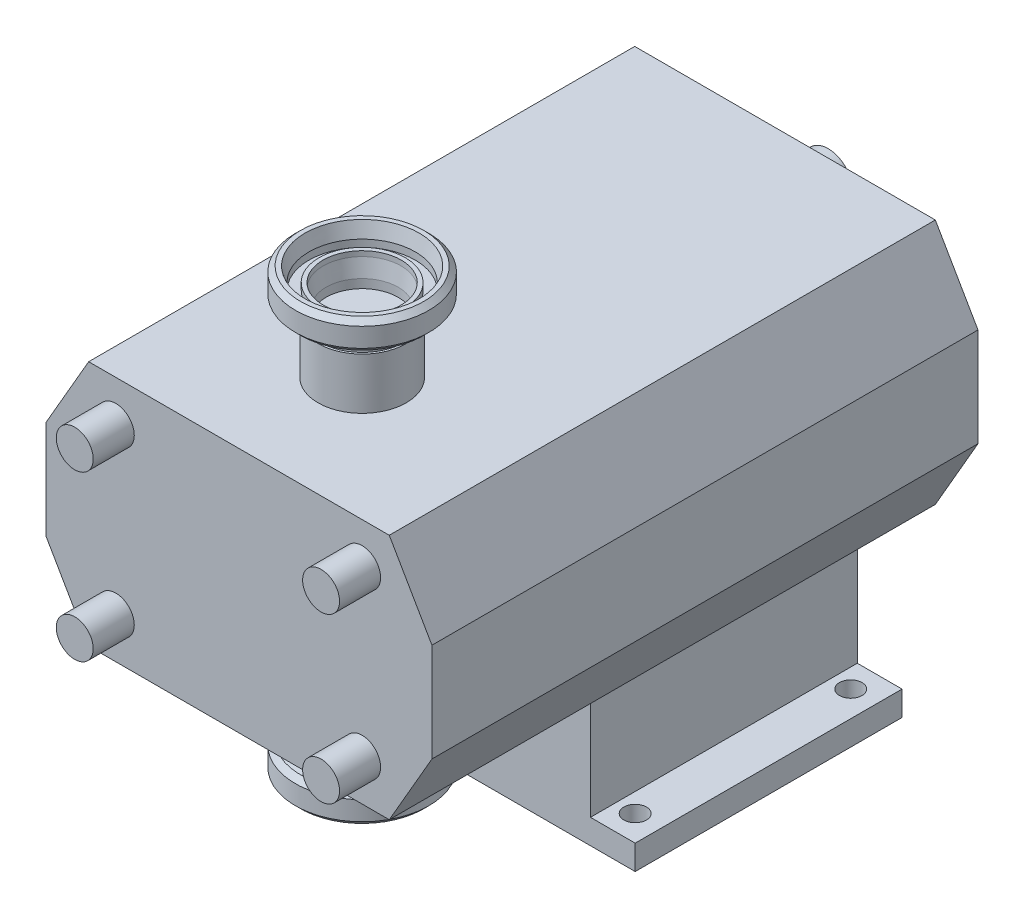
ISO-10303-21;
HEADER;
FILE_DESCRIPTION(('STEP AP214'),'2;1');
FILE_NAME('part.step','',(''),(''),'','','');
FILE_SCHEMA(('AUTOMOTIVE_DESIGN { 1 0 10303 214 1 1 1 1 }'));
ENDSEC;
DATA;
#1=APPLICATION_CONTEXT('core data for automotive mechanical design processes');
#2=APPLICATION_PROTOCOL_DEFINITION('international standard','automotive_design',2000,#1);
#3=PRODUCT_CONTEXT('',#1,'mechanical');
#4=PRODUCT('Part','Part','',(#3));
#5=PRODUCT_RELATED_PRODUCT_CATEGORY('part','',(#4));
#6=PRODUCT_DEFINITION_FORMATION('','',#4);
#7=PRODUCT_DEFINITION_CONTEXT('part definition',#1,'design');
#8=PRODUCT_DEFINITION('design','',#6,#7);
#9=PRODUCT_DEFINITION_SHAPE('','',#8);
#10=(LENGTH_UNIT() NAMED_UNIT(*) SI_UNIT(.MILLI.,.METRE.));
#11=(NAMED_UNIT(*) PLANE_ANGLE_UNIT() SI_UNIT($,.RADIAN.));
#12=(NAMED_UNIT(*) SI_UNIT($,.STERADIAN.) SOLID_ANGLE_UNIT());
#13=UNCERTAINTY_MEASURE_WITH_UNIT(LENGTH_MEASURE(1.E-05),#10,'distance_accuracy_value','');
#14=(GEOMETRIC_REPRESENTATION_CONTEXT(3) GLOBAL_UNCERTAINTY_ASSIGNED_CONTEXT((#13)) GLOBAL_UNIT_ASSIGNED_CONTEXT((#10,
#11,#12)) REPRESENTATION_CONTEXT('',''));
#15=CARTESIAN_POINT('',(0.,0.,0.));
#16=DIRECTION('',(0.,0.,1.));
#17=DIRECTION('',(1.,0.,0.));
#18=AXIS2_PLACEMENT_3D('',#15,#16,#17);
#19=CARTESIAN_POINT('',(-31.,0.,241.732657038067));
#20=DIRECTION('',(0.,0.,1.));
#21=DIRECTION('',(1.,0.,0.));
#22=AXIS2_PLACEMENT_3D('',#19,#20,#21);
#23=CYLINDRICAL_SURFACE('',#22,12.);
#24=CARTESIAN_POINT('',(-31.,0.,-2.));
#25=DIRECTION('',(0.,0.,1.));
#26=DIRECTION('',(1.,0.,0.));
#27=AXIS2_PLACEMENT_3D('',#24,#25,#26);
#28=CIRCLE('',#27,12.);
#29=CARTESIAN_POINT('',(-19.,0.,-2.));
#30=VERTEX_POINT('',#29);
#31=EDGE_CURVE('P0_E277',#30,#30,#28,.T.);
#32=ORIENTED_EDGE('',*,*,#31,.F.);
#33=EDGE_LOOP('',(#32));
#34=FACE_BOUND('',#33,.T.);
#35=DIRECTION('',(0.,0.,1.));
#36=VECTOR('',#35,1.);
#37=CARTESIAN_POINT('',(-19.6862915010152,3.99999999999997,241.732657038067));
#38=LINE('',#37,#36);
#39=CARTESIAN_POINT('',(-19.6862915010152,4.,-52.));
#40=VERTEX_POINT('',#39);
#41=CARTESIAN_POINT('',(-19.6862915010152,4.,-22.));
#42=VERTEX_POINT('',#41);
#43=EDGE_CURVE('P0_E178',#40,#42,#38,.T.);
#44=ORIENTED_EDGE('',*,*,#43,.F.);
#45=CARTESIAN_POINT('',(-31.,0.,-52.));
#46=DIRECTION('',(0.,0.,1.));
#47=DIRECTION('',(1.,0.,0.));
#48=AXIS2_PLACEMENT_3D('',#45,#46,#47);
#49=CIRCLE('',#48,12.);
#50=CARTESIAN_POINT('',(-19.6862915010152,-4.,-52.));
#51=VERTEX_POINT('',#50);
#52=EDGE_CURVE('P0_E176',#40,#51,#49,.T.);
#53=ORIENTED_EDGE('',*,*,#52,.T.);
#54=DIRECTION('',(0.,0.,1.));
#55=VECTOR('',#54,1.);
#56=CARTESIAN_POINT('',(-19.6862915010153,-4.00000000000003,241.732657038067));
#57=LINE('',#56,#55);
#58=CARTESIAN_POINT('',(-19.6862915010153,-4.00000000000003,-22.));
#59=VERTEX_POINT('',#58);
#60=EDGE_CURVE('P0_E39',#59,#51,#57,.F.);
#61=ORIENTED_EDGE('',*,*,#60,.F.);
#62=CARTESIAN_POINT('',(-19.,0.,-26.));
#63=CARTESIAN_POINT('',(-18.9999993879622,0.218253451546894,-26.0000010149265));
#64=CARTESIAN_POINT('',(-19.0060092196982,0.436500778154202,-25.9820789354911));
#65=CARTESIAN_POINT('',(-19.0293915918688,0.866567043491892,-25.9110835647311));
#66=CARTESIAN_POINT('',(-19.0467653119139,1.07838531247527,-25.8580066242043));
#67=CARTESIAN_POINT('',(-19.0909876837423,1.4893311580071,-25.7187230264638));
#68=CARTESIAN_POINT('',(-19.1178204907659,1.68847930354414,-25.6325717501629));
#69=CARTESIAN_POINT('',(-19.1782221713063,2.0694997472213,-25.4298353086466));
#70=CARTESIAN_POINT('',(-19.2117923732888,2.25136862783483,-25.3132441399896));
#71=CARTESIAN_POINT('',(-19.2834362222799,2.59896670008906,-25.048696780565));
#72=CARTESIAN_POINT('',(-19.3216177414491,2.76401480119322,-24.899875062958));
#73=CARTESIAN_POINT('',(-19.3975874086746,3.06733077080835,-24.5769313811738));
#74=CARTESIAN_POINT('',(-19.4353754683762,3.20559274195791,-24.4028038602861));
#75=CARTESIAN_POINT('',(-19.5074667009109,3.45529976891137,-24.028059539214));
#76=CARTESIAN_POINT('',(-19.5416384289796,3.5658594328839,-23.826825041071));
#77=CARTESIAN_POINT('',(-19.6009877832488,3.75127549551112,-23.4072956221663));
#78=CARTESIAN_POINT('',(-19.6261681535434,3.82614278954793,-23.1890059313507));
#79=CARTESIAN_POINT('',(-19.6635478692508,3.93549384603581,-22.7493071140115));
#80=CARTESIAN_POINT('',(-19.6761561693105,3.97125379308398,-22.5282511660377));
#81=CARTESIAN_POINT('',(-19.6881737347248,4.005364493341,-22.0829449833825));
#82=CARTESIAN_POINT('',(-19.687587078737,4.00372680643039,-21.8586957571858));
#83=CARTESIAN_POINT('',(-19.6736394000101,3.96407961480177,-21.4242534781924));
#84=CARTESIAN_POINT('',(-19.6608633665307,3.92773565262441,-21.2138863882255));
#85=CARTESIAN_POINT('',(-19.6249336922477,3.82242465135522,-20.8024263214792));
#86=CARTESIAN_POINT('',(-19.6017788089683,3.75345370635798,-20.601334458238));
#87=CARTESIAN_POINT('',(-19.5472835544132,3.58375623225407,-20.2103490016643));
#88=CARTESIAN_POINT('',(-19.5158173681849,3.4825361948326,-20.02068789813));
#89=CARTESIAN_POINT('',(-19.4482976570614,3.251556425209,-19.660516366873));
#90=CARTESIAN_POINT('',(-19.4122428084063,3.12178844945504,-19.4900114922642));
#91=CARTESIAN_POINT('',(-19.3373068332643,2.82939733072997,-19.1636336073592));
#92=CARTESIAN_POINT('',(-19.2983764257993,2.66541260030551,-19.0089892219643));
#93=CARTESIAN_POINT('',(-19.2237224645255,2.31335827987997,-18.7290749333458));
#94=CARTESIAN_POINT('',(-19.1879992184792,2.12528638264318,-18.6038078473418));
#95=CARTESIAN_POINT('',(-19.1233156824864,1.72779045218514,-18.3852147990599));
#96=CARTESIAN_POINT('',(-19.0944259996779,1.51817310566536,-18.2922180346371));
#97=CARTESIAN_POINT('',(-19.0471773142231,1.085076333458,-18.1431873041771));
#98=CARTESIAN_POINT('',(-19.028814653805,0.861601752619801,-18.0871404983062));
#99=CARTESIAN_POINT('',(-19.0052949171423,0.417535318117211,-18.0157773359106));
#100=CARTESIAN_POINT('',(-18.9995999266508,0.197238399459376,-17.998800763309));
#101=CARTESIAN_POINT('',(-19.0004438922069,-0.24310027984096,-18.0013306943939));
#102=CARTESIAN_POINT('',(-19.0069807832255,-0.463142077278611,-18.0208310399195));
#103=CARTESIAN_POINT('',(-19.0311990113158,-0.89007946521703,-18.0944476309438));
#104=CARTESIAN_POINT('',(-19.0485520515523,-1.09717122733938,-18.147544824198));
#105=CARTESIAN_POINT('',(-19.0923261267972,-1.4994238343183,-18.2855737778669));
#106=CARTESIAN_POINT('',(-19.118748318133,-1.69458315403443,-18.3705095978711));
#107=CARTESIAN_POINT('',(-19.1788427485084,-2.0731531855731,-18.5722817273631));
#108=CARTESIAN_POINT('',(-19.2126874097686,-2.25611983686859,-18.6898983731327));
#109=CARTESIAN_POINT('',(-19.2837898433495,-2.60025932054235,-18.9527766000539));
#110=CARTESIAN_POINT('',(-19.3210486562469,-2.76142547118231,-19.0980466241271));
#111=CARTESIAN_POINT('',(-19.3969260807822,-3.06501003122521,-19.4199150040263));
#112=CARTESIAN_POINT('',(-19.4355295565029,-3.20624387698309,-19.5976369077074));
#113=CARTESIAN_POINT('',(-19.5080010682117,-3.45703008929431,-19.9750862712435));
#114=CARTESIAN_POINT('',(-19.5418690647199,-3.56658219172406,-20.1748139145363));
#115=CARTESIAN_POINT('',(-19.6007043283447,-3.75038772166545,-20.5906920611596));
#116=CARTESIAN_POINT('',(-19.6256895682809,-3.82471252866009,-20.8068083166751));
#117=CARTESIAN_POINT('',(-19.663566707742,-3.93557866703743,-21.2495146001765));
#118=CARTESIAN_POINT('',(-19.6764640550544,-3.97213701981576,-21.4760998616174));
#119=CARTESIAN_POINT('',(-19.6880856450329,-4.00510512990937,-21.9207883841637));
#120=CARTESIAN_POINT('',(-19.6875039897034,-4.0034810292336,-22.1387293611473));
#121=CARTESIAN_POINT('',(-19.6739492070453,-3.96496917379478,-22.5710602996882));
#122=CARTESIAN_POINT('',(-19.6609768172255,-3.92808351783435,-22.7854504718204));
#123=CARTESIAN_POINT('',(-19.6246190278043,-3.82148725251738,-23.2005426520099));
#124=CARTESIAN_POINT('',(-19.6014360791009,-3.75241338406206,-23.401427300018));
#125=CARTESIAN_POINT('',(-19.5473440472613,-3.58391746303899,-23.7889096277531));
#126=CARTESIAN_POINT('',(-19.5164332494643,-3.48448867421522,-23.975504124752));
#127=CARTESIAN_POINT('',(-19.4486868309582,-3.25304277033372,-24.3379346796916));
#128=CARTESIAN_POINT('',(-19.4116515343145,-3.11979297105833,-24.5129460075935));
#129=CARTESIAN_POINT('',(-19.3366657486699,-2.8265715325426,-24.8387592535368));
#130=CARTESIAN_POINT('',(-19.2987150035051,-2.66659233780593,-24.9895543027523));
#131=CARTESIAN_POINT('',(-19.2243987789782,-2.31696622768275,-25.2685776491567));
#132=CARTESIAN_POINT('',(-19.1881527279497,-2.12640605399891,-25.395697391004));
#133=CARTESIAN_POINT('',(-19.1229603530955,-1.7254294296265,-25.6159617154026));
#134=CARTESIAN_POINT('',(-19.0940121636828,-1.51501807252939,-25.7091149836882));
#135=CARTESIAN_POINT('',(-19.0477793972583,-1.0899745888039,-25.8548865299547));
#136=CARTESIAN_POINT('',(-19.0300315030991,-0.875951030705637,-25.9091298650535));
#137=CARTESIAN_POINT('',(-19.0061437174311,-0.441281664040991,-25.9816811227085));
#138=CARTESIAN_POINT('',(-19.0000006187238,-0.220637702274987,-25.9999989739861));
#139=CARTESIAN_POINT('',(-19.,0.,-26.));
#140=B_SPLINE_CURVE_WITH_KNOTS('',3,(#62,#63,#64,#65,#66,#67,#68,#69,#70,#71,#72,#73,#74,#75,
#76,#77,#78,#79,#80,#81,#82,#83,#84,#85,#86,#87,#88,#89,#90,#91,#92,#93,#94,#95,#96,#97,#98,#99,
#100,#101,#102,#103,#104,#105,#106,#107,#108,#109,#110,#111,#112,#113,#114,#115,#116,#117,#118,
#119,#120,#121,#122,#123,#124,#125,#126,#127,#128,#129,#130,#131,#132,#133,#134,#135,#136,#137,
#138,#139),.UNSPECIFIED.,.T.,.F.,(4,2,2,2,2,2,2,2,2,2,2,2,2,2,2,2,2,2,2,2,2,2,2,2,2,2,2,2,2,2,2,
2,2,2,2,2,2,2,4),(0.,0.653948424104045,1.30796474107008,1.96089069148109,2.6139455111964,
3.28738737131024,3.96097733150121,4.65393539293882,5.34668178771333,6.01607702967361,
6.68526535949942,7.32387306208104,7.96255723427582,8.61152684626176,9.26068410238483,
9.94373223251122,10.6268458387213,11.3167362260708,12.0063867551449,12.6661433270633,
13.3257885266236,13.9663263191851,14.6069458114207,15.264415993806,15.9220872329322,
16.6096409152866,17.2972003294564,17.9833605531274,18.6692113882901,19.3198266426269,
19.9704031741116,20.6086234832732,21.2469855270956,21.9132026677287,22.5796084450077,
23.2719864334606,23.9641872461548,24.6254623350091,25.2865546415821),.UNSPECIFIED.);
#141=EDGE_CURVE('P0_E11',#42,#59,#140,.T.);
#142=ORIENTED_EDGE('',*,*,#141,.F.);
#143=EDGE_LOOP('',(#44,#53,#61,#142));
#144=FACE_BOUND('',#143,.T.);
#145=ADVANCED_FACE('P0_F17',(#34,#144),#23,.T.);
#146=CARTESIAN_POINT('',(-73.2153903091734,-60.,266.));
#147=DIRECTION('',(0.,1.,0.));
#148=DIRECTION('',(-1.,0.,0.));
#149=AXIS2_PLACEMENT_3D('',#146,#147,#148);
#150=PLANE('',#149);
#151=CARTESIAN_POINT('',(0.,-60.,206.));
#152=DIRECTION('',(0.,1.,0.));
#153=DIRECTION('',(-1.,0.,0.));
#154=AXIS2_PLACEMENT_3D('',#151,#152,#153);
#155=CIRCLE('',#154,21.5);
#156=CARTESIAN_POINT('',(-21.5,-60.,206.));
#157=VERTEX_POINT('',#156);
#158=EDGE_CURVE('P0_E192',#157,#157,#155,.T.);
#159=ORIENTED_EDGE('',*,*,#158,.T.);
#160=EDGE_LOOP('',(#159));
#161=FACE_BOUND('',#160,.T.);
#162=DIRECTION('',(1.,0.,0.));
#163=VECTOR('',#162,1.);
#164=CARTESIAN_POINT('',(-73.2153903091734,-60.,0.));
#165=LINE('',#164,#163);
#166=CARTESIAN_POINT('',(-73.2153903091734,-60.,0.));
#167=VERTEX_POINT('',#166);
#168=CARTESIAN_POINT('',(73.2153903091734,-60.,0.));
#169=VERTEX_POINT('',#168);
#170=EDGE_CURVE('P0_E337',#167,#169,#165,.T.);
#171=ORIENTED_EDGE('',*,*,#170,.T.);
#172=DIRECTION('',(0.,0.,-1.));
#173=VECTOR('',#172,1.);
#174=CARTESIAN_POINT('',(73.2153903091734,-60.,266.));
#175=LINE('',#174,#173);
#176=CARTESIAN_POINT('',(73.2153903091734,-60.,266.));
#177=VERTEX_POINT('',#176);
#178=EDGE_CURVE('P0_E347',#177,#169,#175,.T.);
#179=ORIENTED_EDGE('',*,*,#178,.F.);
#180=DIRECTION('',(1.,0.,0.));
#181=VECTOR('',#180,1.);
#182=CARTESIAN_POINT('',(-73.2153903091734,-60.,266.));
#183=LINE('',#182,#181);
#184=CARTESIAN_POINT('',(-73.2153903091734,-60.,266.));
#185=VERTEX_POINT('',#184);
#186=EDGE_CURVE('P0_E320',#185,#177,#183,.T.);
#187=ORIENTED_EDGE('',*,*,#186,.F.);
#188=DIRECTION('',(0.,0.,-1.));
#189=VECTOR('',#188,1.);
#190=CARTESIAN_POINT('',(-73.2153903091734,-60.,266.));
#191=LINE('',#190,#189);
#192=EDGE_CURVE('P0_E350',#185,#167,#191,.T.);
#193=ORIENTED_EDGE('',*,*,#192,.T.);
#194=EDGE_LOOP('',(#171,#179,#187,#193));
#195=FACE_BOUND('',#194,.T.);
#196=DIRECTION('',(1.,0.,0.));
#197=VECTOR('',#196,1.);
#198=CARTESIAN_POINT('',(53.2153903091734,-60.,18.));
#199=LINE('',#198,#197);
#200=CARTESIAN_POINT('',(-53.2153903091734,-60.,18.));
#201=VERTEX_POINT('',#200);
#202=CARTESIAN_POINT('',(53.2153903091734,-60.,18.));
#203=VERTEX_POINT('',#202);
#204=EDGE_CURVE('P0_E220',#201,#203,#199,.T.);
#205=ORIENTED_EDGE('',*,*,#204,.F.);
#206=DIRECTION('',(0.,0.,1.));
#207=VECTOR('',#206,1.);
#208=CARTESIAN_POINT('',(-53.2153903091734,-60.,18.));
#209=LINE('',#208,#207);
#210=CARTESIAN_POINT('',(-53.2153903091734,-60.,148.));
#211=VERTEX_POINT('',#210);
#212=EDGE_CURVE('P0_E238',#201,#211,#209,.T.);
#213=ORIENTED_EDGE('',*,*,#212,.T.);
#214=DIRECTION('',(1.,0.,0.));
#215=VECTOR('',#214,1.);
#216=CARTESIAN_POINT('',(53.2153903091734,-60.,148.));
#217=LINE('',#216,#215);
#218=CARTESIAN_POINT('',(53.2153903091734,-60.,148.));
#219=VERTEX_POINT('',#218);
#220=EDGE_CURVE('P0_E219',#211,#219,#217,.T.);
#221=ORIENTED_EDGE('',*,*,#220,.T.);
#222=DIRECTION('',(0.,0.,1.));
#223=VECTOR('',#222,1.);
#224=CARTESIAN_POINT('',(53.2153903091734,-60.,18.));
#225=LINE('',#224,#223);
#226=EDGE_CURVE('P0_E274',#203,#219,#225,.T.);
#227=ORIENTED_EDGE('',*,*,#226,.F.);
#228=EDGE_LOOP('',(#205,#213,#221,#227));
#229=FACE_BOUND('',#228,.T.);
#230=ADVANCED_FACE('P0_F393',(#161,#195,#229),#150,.F.);
#231=CARTESIAN_POINT('',(107.856406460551,0.,0.));
#232=DIRECTION('',(0.,0.,1.));
#233=DIRECTION('',(1.,0.,0.));
#234=AXIS2_PLACEMENT_3D('',#231,#232,#233);
#235=PLANE('',#234);
#236=DIRECTION('',(-0.500000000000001,0.866025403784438,0.));
#237=VECTOR('',#236,1.);
#238=CARTESIAN_POINT('',(73.2153903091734,60.,0.));
#239=LINE('',#238,#237);
#240=CARTESIAN_POINT('',(94.,24.,0.));
#241=VERTEX_POINT('',#240);
#242=CARTESIAN_POINT('',(73.2153903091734,60.,0.));
#243=VERTEX_POINT('',#242);
#244=EDGE_CURVE('P0_E305',#241,#243,#239,.T.);
#245=ORIENTED_EDGE('',*,*,#244,.F.);
#246=DIRECTION('',(0.,1.,0.));
#247=VECTOR('',#246,1.);
#248=CARTESIAN_POINT('',(94.,24.,0.));
#249=LINE('',#248,#247);
#250=CARTESIAN_POINT('',(94.,-24.,0.));
#251=VERTEX_POINT('',#250);
#252=EDGE_CURVE('P0_E312',#251,#241,#249,.T.);
#253=ORIENTED_EDGE('',*,*,#252,.F.);
#254=DIRECTION('',(0.500000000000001,0.866025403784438,0.));
#255=VECTOR('',#254,1.);
#256=CARTESIAN_POINT('',(73.2153903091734,-60.,0.));
#257=LINE('',#256,#255);
#258=EDGE_CURVE('P0_E339',#169,#251,#257,.T.);
#259=ORIENTED_EDGE('',*,*,#258,.F.);
#260=ORIENTED_EDGE('',*,*,#170,.F.);
#261=DIRECTION('',(0.500000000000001,-0.866025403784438,0.));
#262=VECTOR('',#261,1.);
#263=CARTESIAN_POINT('',(-73.2153903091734,-60.,0.));
#264=LINE('',#263,#262);
#265=CARTESIAN_POINT('',(-94.,-24.,0.));
#266=VERTEX_POINT('',#265);
#267=EDGE_CURVE('P0_E335',#266,#167,#264,.T.);
#268=ORIENTED_EDGE('',*,*,#267,.F.);
#269=DIRECTION('',(0.,-1.,0.));
#270=VECTOR('',#269,1.);
#271=CARTESIAN_POINT('',(-94.,24.,0.));
#272=LINE('',#271,#270);
#273=CARTESIAN_POINT('',(-94.,24.,0.));
#274=VERTEX_POINT('',#273);
#275=EDGE_CURVE('P0_E333',#274,#266,#272,.T.);
#276=ORIENTED_EDGE('',*,*,#275,.F.);
#277=DIRECTION('',(-0.500000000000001,-0.866025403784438,0.));
#278=VECTOR('',#277,1.);
#279=CARTESIAN_POINT('',(-73.2153903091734,60.,0.));
#280=LINE('',#279,#278);
#281=CARTESIAN_POINT('',(-73.2153903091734,60.,0.));
#282=VERTEX_POINT('',#281);
#283=EDGE_CURVE('P0_E331',#282,#274,#280,.T.);
#284=ORIENTED_EDGE('',*,*,#283,.F.);
#285=DIRECTION('',(-1.,0.,0.));
#286=VECTOR('',#285,1.);
#287=CARTESIAN_POINT('',(-73.2153903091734,60.,0.));
#288=LINE('',#287,#286);
#289=EDGE_CURVE('P0_E329',#243,#282,#288,.T.);
#290=ORIENTED_EDGE('',*,*,#289,.F.);
#291=EDGE_LOOP('',(#245,#253,#259,#260,#268,#276,#284,#290));
#292=FACE_BOUND('',#291,.T.);
#293=CARTESIAN_POINT('',(-31.,0.,0.));
#294=DIRECTION('',(0.,0.,1.));
#295=DIRECTION('',(1.,0.,0.));
#296=AXIS2_PLACEMENT_3D('',#293,#294,#295);
#297=CIRCLE('',#296,15.);
#298=CARTESIAN_POINT('',(-16.,0.,0.));
#299=VERTEX_POINT('',#298);
#300=EDGE_CURVE('P0_E29',#299,#299,#297,.F.);
#301=ORIENTED_EDGE('',*,*,#300,.F.);
#302=EDGE_LOOP('',(#301));
#303=FACE_BOUND('',#302,.T.);
#304=ADVANCED_FACE('P0_F399',(#292,#303),#235,.F.);
#305=CARTESIAN_POINT('',(107.856406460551,0.,266.));
#306=DIRECTION('',(0.,0.,1.));
#307=DIRECTION('',(1.,0.,0.));
#308=AXIS2_PLACEMENT_3D('',#305,#306,#307);
#309=PLANE('',#308);
#310=CARTESIAN_POINT('',(60.,-40.,266.));
#311=DIRECTION('',(0.,0.,1.));
#312=DIRECTION('',(1.,0.,0.));
#313=AXIS2_PLACEMENT_3D('',#310,#311,#312);
#314=CIRCLE('',#313,9.);
#315=CARTESIAN_POINT('',(69.,-40.,266.));
#316=VERTEX_POINT('',#315);
#317=EDGE_CURVE('P0_E287',#316,#316,#314,.T.);
#318=ORIENTED_EDGE('',*,*,#317,.F.);
#319=EDGE_LOOP('',(#318));
#320=FACE_BOUND('',#319,.T.);
#321=CARTESIAN_POINT('',(-60.,40.,266.));
#322=DIRECTION('',(0.,0.,1.));
#323=DIRECTION('',(1.,0.,0.));
#324=AXIS2_PLACEMENT_3D('',#321,#322,#323);
#325=CIRCLE('',#324,9.);
#326=CARTESIAN_POINT('',(-51.,40.,266.));
#327=VERTEX_POINT('',#326);
#328=EDGE_CURVE('P0_E299',#327,#327,#325,.T.);
#329=ORIENTED_EDGE('',*,*,#328,.F.);
#330=EDGE_LOOP('',(#329));
#331=FACE_BOUND('',#330,.T.);
#332=DIRECTION('',(-0.500000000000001,0.866025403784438,0.));
#333=VECTOR('',#332,1.);
#334=CARTESIAN_POINT('',(73.2153903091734,60.,266.));
#335=LINE('',#334,#333);
#336=CARTESIAN_POINT('',(94.,24.,266.));
#337=VERTEX_POINT('',#336);
#338=CARTESIAN_POINT('',(73.2153903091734,60.,266.));
#339=VERTEX_POINT('',#338);
#340=EDGE_CURVE('P0_E308',#337,#339,#335,.T.);
#341=ORIENTED_EDGE('',*,*,#340,.T.);
#342=DIRECTION('',(-1.,0.,0.));
#343=VECTOR('',#342,1.);
#344=CARTESIAN_POINT('',(-73.2153903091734,60.,266.));
#345=LINE('',#344,#343);
#346=CARTESIAN_POINT('',(-73.2153903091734,60.,266.));
#347=VERTEX_POINT('',#346);
#348=EDGE_CURVE('P0_E311',#339,#347,#345,.T.);
#349=ORIENTED_EDGE('',*,*,#348,.T.);
#350=DIRECTION('',(-0.500000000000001,-0.866025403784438,0.));
#351=VECTOR('',#350,1.);
#352=CARTESIAN_POINT('',(-73.2153903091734,60.,266.));
#353=LINE('',#352,#351);
#354=CARTESIAN_POINT('',(-94.,24.,266.));
#355=VERTEX_POINT('',#354);
#356=EDGE_CURVE('P0_E314',#347,#355,#353,.T.);
#357=ORIENTED_EDGE('',*,*,#356,.T.);
#358=DIRECTION('',(0.,-1.,0.));
#359=VECTOR('',#358,1.);
#360=CARTESIAN_POINT('',(-94.,24.,266.));
#361=LINE('',#360,#359);
#362=CARTESIAN_POINT('',(-94.,-24.,266.));
#363=VERTEX_POINT('',#362);
#364=EDGE_CURVE('P0_E316',#355,#363,#361,.T.);
#365=ORIENTED_EDGE('',*,*,#364,.T.);
#366=DIRECTION('',(0.500000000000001,-0.866025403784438,0.));
#367=VECTOR('',#366,1.);
#368=CARTESIAN_POINT('',(-73.2153903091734,-60.,266.));
#369=LINE('',#368,#367);
#370=EDGE_CURVE('P0_E318',#363,#185,#369,.T.);
#371=ORIENTED_EDGE('',*,*,#370,.T.);
#372=ORIENTED_EDGE('',*,*,#186,.T.);
#373=DIRECTION('',(0.500000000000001,0.866025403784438,0.));
#374=VECTOR('',#373,1.);
#375=CARTESIAN_POINT('',(73.2153903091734,-60.,266.));
#376=LINE('',#375,#374);
#377=CARTESIAN_POINT('',(94.,-24.,266.));
#378=VERTEX_POINT('',#377);
#379=EDGE_CURVE('P0_E322',#177,#378,#376,.T.);
#380=ORIENTED_EDGE('',*,*,#379,.T.);
#381=DIRECTION('',(0.,1.,0.));
#382=VECTOR('',#381,1.);
#383=CARTESIAN_POINT('',(94.,24.,266.));
#384=LINE('',#383,#382);
#385=EDGE_CURVE('P0_E324',#378,#337,#384,.T.);
#386=ORIENTED_EDGE('',*,*,#385,.T.);
#387=EDGE_LOOP('',(#341,#349,#357,#365,#371,#372,#380,#386));
#388=FACE_BOUND('',#387,.T.);
#389=CARTESIAN_POINT('',(60.,40.,266.));
#390=DIRECTION('',(0.,0.,1.));
#391=DIRECTION('',(1.,0.,0.));
#392=AXIS2_PLACEMENT_3D('',#389,#390,#391);
#393=CIRCLE('',#392,9.);
#394=CARTESIAN_POINT('',(69.,40.,266.));
#395=VERTEX_POINT('',#394);
#396=EDGE_CURVE('P0_E293',#395,#395,#393,.T.);
#397=ORIENTED_EDGE('',*,*,#396,.F.);
#398=EDGE_LOOP('',(#397));
#399=FACE_BOUND('',#398,.T.);
#400=CARTESIAN_POINT('',(-60.,-40.,266.));
#401=DIRECTION('',(0.,0.,1.));
#402=DIRECTION('',(1.,0.,0.));
#403=AXIS2_PLACEMENT_3D('',#400,#401,#402);
#404=CIRCLE('',#403,9.);
#405=CARTESIAN_POINT('',(-51.,-40.,266.));
#406=VERTEX_POINT('',#405);
#407=EDGE_CURVE('P0_E283',#406,#406,#404,.T.);
#408=ORIENTED_EDGE('',*,*,#407,.F.);
#409=EDGE_LOOP('',(#408));
#410=FACE_BOUND('',#409,.T.);
#411=ADVANCED_FACE('P0_F448',(#320,#331,#388,#399,#410),#309,.T.);
#412=CARTESIAN_POINT('',(73.2153903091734,60.,266.));
#413=DIRECTION('',(-0.866025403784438,-0.500000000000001,0.));
#414=DIRECTION('',(0.500000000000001,-0.866025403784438,0.));
#415=AXIS2_PLACEMENT_3D('',#412,#413,#414);
#416=PLANE('',#415);
#417=ORIENTED_EDGE('',*,*,#244,.T.);
#418=DIRECTION('',(0.,0.,-1.));
#419=VECTOR('',#418,1.);
#420=CARTESIAN_POINT('',(73.2153903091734,60.,266.));
#421=LINE('',#420,#419);
#422=EDGE_CURVE('P0_E362',#339,#243,#421,.T.);
#423=ORIENTED_EDGE('',*,*,#422,.F.);
#424=ORIENTED_EDGE('',*,*,#340,.F.);
#425=DIRECTION('',(0.,0.,-1.));
#426=VECTOR('',#425,1.);
#427=CARTESIAN_POINT('',(94.,24.,266.));
#428=LINE('',#427,#426);
#429=EDGE_CURVE('P0_E326',#337,#241,#428,.T.);
#430=ORIENTED_EDGE('',*,*,#429,.T.);
#431=EDGE_LOOP('',(#417,#423,#424,#430));
#432=FACE_BOUND('',#431,.T.);
#433=ADVANCED_FACE('P0_F19',(#432),#416,.F.);
#434=CARTESIAN_POINT('',(-73.2153903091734,60.,266.));
#435=DIRECTION('',(0.,-1.,0.));
#436=DIRECTION('',(1.,0.,0.));
#437=AXIS2_PLACEMENT_3D('',#434,#435,#436);
#438=PLANE('',#437);
#439=CARTESIAN_POINT('',(0.,60.,206.));
#440=DIRECTION('',(0.,-1.,0.));
#441=DIRECTION('',(1.,0.,0.));
#442=AXIS2_PLACEMENT_3D('',#439,#440,#441);
#443=CIRCLE('',#442,21.5);
#444=CARTESIAN_POINT('',(21.5,60.,206.));
#445=VERTEX_POINT('',#444);
#446=EDGE_CURVE('P0_E191',#445,#445,#443,.T.);
#447=ORIENTED_EDGE('',*,*,#446,.T.);
#448=EDGE_LOOP('',(#447));
#449=FACE_BOUND('',#448,.T.);
#450=ORIENTED_EDGE('',*,*,#289,.T.);
#451=DIRECTION('',(0.,0.,-1.));
#452=VECTOR('',#451,1.);
#453=CARTESIAN_POINT('',(-73.2153903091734,60.,266.));
#454=LINE('',#453,#452);
#455=EDGE_CURVE('P0_E359',#347,#282,#454,.T.);
#456=ORIENTED_EDGE('',*,*,#455,.F.);
#457=ORIENTED_EDGE('',*,*,#348,.F.);
#458=ORIENTED_EDGE('',*,*,#422,.T.);
#459=EDGE_LOOP('',(#450,#456,#457,#458));
#460=FACE_BOUND('',#459,.T.);
#461=ADVANCED_FACE('P0_F369',(#449,#460),#438,.F.);
#462=CARTESIAN_POINT('',(-73.2153903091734,60.,266.));
#463=DIRECTION('',(0.866025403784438,-0.500000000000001,0.));
#464=DIRECTION('',(0.500000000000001,0.866025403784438,0.));
#465=AXIS2_PLACEMENT_3D('',#462,#463,#464);
#466=PLANE('',#465);
#467=ORIENTED_EDGE('',*,*,#283,.T.);
#468=DIRECTION('',(0.,0.,-1.));
#469=VECTOR('',#468,1.);
#470=CARTESIAN_POINT('',(-94.,24.,266.));
#471=LINE('',#470,#469);
#472=EDGE_CURVE('P0_E356',#355,#274,#471,.T.);
#473=ORIENTED_EDGE('',*,*,#472,.F.);
#474=ORIENTED_EDGE('',*,*,#356,.F.);
#475=ORIENTED_EDGE('',*,*,#455,.T.);
#476=EDGE_LOOP('',(#467,#473,#474,#475));
#477=FACE_BOUND('',#476,.T.);
#478=ADVANCED_FACE('P0_F469',(#477),#466,.F.);
#479=CARTESIAN_POINT('',(-94.,24.,266.));
#480=DIRECTION('',(1.,0.,0.));
#481=DIRECTION('',(0.,0.,-1.));
#482=AXIS2_PLACEMENT_3D('',#479,#480,#481);
#483=PLANE('',#482);
#484=ORIENTED_EDGE('',*,*,#275,.T.);
#485=DIRECTION('',(0.,0.,-1.));
#486=VECTOR('',#485,1.);
#487=CARTESIAN_POINT('',(-94.,-24.,266.));
#488=LINE('',#487,#486);
#489=EDGE_CURVE('P0_E353',#363,#266,#488,.T.);
#490=ORIENTED_EDGE('',*,*,#489,.F.);
#491=ORIENTED_EDGE('',*,*,#364,.F.);
#492=ORIENTED_EDGE('',*,*,#472,.T.);
#493=EDGE_LOOP('',(#484,#490,#491,#492));
#494=FACE_BOUND('',#493,.T.);
#495=ADVANCED_FACE('P0_F465',(#494),#483,.F.);
#496=CARTESIAN_POINT('',(-73.2153903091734,-60.,266.));
#497=DIRECTION('',(0.866025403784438,0.500000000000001,0.));
#498=DIRECTION('',(-0.500000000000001,0.866025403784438,0.));
#499=AXIS2_PLACEMENT_3D('',#496,#497,#498);
#500=PLANE('',#499);
#501=ORIENTED_EDGE('',*,*,#267,.T.);
#502=ORIENTED_EDGE('',*,*,#192,.F.);
#503=ORIENTED_EDGE('',*,*,#370,.F.);
#504=ORIENTED_EDGE('',*,*,#489,.T.);
#505=EDGE_LOOP('',(#501,#502,#503,#504));
#506=FACE_BOUND('',#505,.T.);
#507=ADVANCED_FACE('P0_F460',(#506),#500,.F.);
#508=CARTESIAN_POINT('',(73.2153903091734,-60.,266.));
#509=DIRECTION('',(-0.866025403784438,0.500000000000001,0.));
#510=DIRECTION('',(-0.500000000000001,-0.866025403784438,0.));
#511=AXIS2_PLACEMENT_3D('',#508,#509,#510);
#512=PLANE('',#511);
#513=ORIENTED_EDGE('',*,*,#258,.T.);
#514=DIRECTION('',(0.,0.,-1.));
#515=VECTOR('',#514,1.);
#516=CARTESIAN_POINT('',(94.,-24.,266.));
#517=LINE('',#516,#515);
#518=EDGE_CURVE('P0_E344',#378,#251,#517,.T.);
#519=ORIENTED_EDGE('',*,*,#518,.F.);
#520=ORIENTED_EDGE('',*,*,#379,.F.);
#521=ORIENTED_EDGE('',*,*,#178,.T.);
#522=EDGE_LOOP('',(#513,#519,#520,#521));
#523=FACE_BOUND('',#522,.T.);
#524=ADVANCED_FACE('P0_F457',(#523),#512,.F.);
#525=CARTESIAN_POINT('',(94.,24.,266.));
#526=DIRECTION('',(-1.,0.,0.));
#527=DIRECTION('',(0.,0.,1.));
#528=AXIS2_PLACEMENT_3D('',#525,#526,#527);
#529=PLANE('',#528);
#530=ORIENTED_EDGE('',*,*,#252,.T.);
#531=ORIENTED_EDGE('',*,*,#429,.F.);
#532=ORIENTED_EDGE('',*,*,#385,.F.);
#533=ORIENTED_EDGE('',*,*,#518,.T.);
#534=EDGE_LOOP('',(#530,#531,#532,#533));
#535=FACE_BOUND('',#534,.T.);
#536=ADVANCED_FACE('P0_F446',(#535),#529,.F.);
#537=CARTESIAN_POINT('',(-60.,40.,286.));
#538=DIRECTION('',(0.,0.,-1.));
#539=DIRECTION('',(-1.,0.,0.));
#540=AXIS2_PLACEMENT_3D('',#537,#538,#539);
#541=CYLINDRICAL_SURFACE('',#540,9.);
#542=CARTESIAN_POINT('',(-60.,40.,286.));
#543=DIRECTION('',(0.,0.,1.));
#544=DIRECTION('',(1.,0.,0.));
#545=AXIS2_PLACEMENT_3D('',#542,#543,#544);
#546=CIRCLE('',#545,9.);
#547=CARTESIAN_POINT('',(-51.,40.,286.));
#548=VERTEX_POINT('',#547);
#549=EDGE_CURVE('P0_E302',#548,#548,#546,.T.);
#550=ORIENTED_EDGE('',*,*,#549,.F.);
#551=EDGE_LOOP('',(#550));
#552=FACE_BOUND('',#551,.T.);
#553=ORIENTED_EDGE('',*,*,#328,.T.);
#554=EDGE_LOOP('',(#553));
#555=FACE_BOUND('',#554,.T.);
#556=ADVANCED_FACE('P0_F442',(#552,#555),#541,.T.);
#557=CARTESIAN_POINT('',(-60.,40.,286.));
#558=DIRECTION('',(0.,0.,1.));
#559=DIRECTION('',(1.,0.,0.));
#560=AXIS2_PLACEMENT_3D('',#557,#558,#559);
#561=PLANE('',#560);
#562=ORIENTED_EDGE('',*,*,#549,.T.);
#563=EDGE_LOOP('',(#562));
#564=FACE_BOUND('',#563,.T.);
#565=ADVANCED_FACE('P0_F438',(#564),#561,.T.);
#566=CARTESIAN_POINT('',(60.,40.,286.));
#567=DIRECTION('',(0.,0.,-1.));
#568=DIRECTION('',(-1.,0.,0.));
#569=AXIS2_PLACEMENT_3D('',#566,#567,#568);
#570=CYLINDRICAL_SURFACE('',#569,9.);
#571=CARTESIAN_POINT('',(60.,40.,286.));
#572=DIRECTION('',(0.,0.,1.));
#573=DIRECTION('',(1.,0.,0.));
#574=AXIS2_PLACEMENT_3D('',#571,#572,#573);
#575=CIRCLE('',#574,9.);
#576=CARTESIAN_POINT('',(69.,40.,286.));
#577=VERTEX_POINT('',#576);
#578=EDGE_CURVE('P0_E296',#577,#577,#575,.T.);
#579=ORIENTED_EDGE('',*,*,#578,.F.);
#580=EDGE_LOOP('',(#579));
#581=FACE_BOUND('',#580,.T.);
#582=ORIENTED_EDGE('',*,*,#396,.T.);
#583=EDGE_LOOP('',(#582));
#584=FACE_BOUND('',#583,.T.);
#585=ADVANCED_FACE('P0_F434',(#581,#584),#570,.T.);
#586=CARTESIAN_POINT('',(60.,40.,286.));
#587=DIRECTION('',(0.,0.,1.));
#588=DIRECTION('',(1.,0.,0.));
#589=AXIS2_PLACEMENT_3D('',#586,#587,#588);
#590=PLANE('',#589);
#591=ORIENTED_EDGE('',*,*,#578,.T.);
#592=EDGE_LOOP('',(#591));
#593=FACE_BOUND('',#592,.T.);
#594=ADVANCED_FACE('P0_F430',(#593),#590,.T.);
#595=CARTESIAN_POINT('',(60.,-40.,286.));
#596=DIRECTION('',(0.,0.,-1.));
#597=DIRECTION('',(-1.,0.,0.));
#598=AXIS2_PLACEMENT_3D('',#595,#596,#597);
#599=CYLINDRICAL_SURFACE('',#598,9.);
#600=CARTESIAN_POINT('',(60.,-40.,286.));
#601=DIRECTION('',(0.,0.,1.));
#602=DIRECTION('',(1.,0.,0.));
#603=AXIS2_PLACEMENT_3D('',#600,#601,#602);
#604=CIRCLE('',#603,9.);
#605=CARTESIAN_POINT('',(69.,-40.,286.));
#606=VERTEX_POINT('',#605);
#607=EDGE_CURVE('P0_E290',#606,#606,#604,.T.);
#608=ORIENTED_EDGE('',*,*,#607,.F.);
#609=EDGE_LOOP('',(#608));
#610=FACE_BOUND('',#609,.T.);
#611=ORIENTED_EDGE('',*,*,#317,.T.);
#612=EDGE_LOOP('',(#611));
#613=FACE_BOUND('',#612,.T.);
#614=ADVANCED_FACE('P0_F426',(#610,#613),#599,.T.);
#615=CARTESIAN_POINT('',(60.,-40.,286.));
#616=DIRECTION('',(0.,0.,1.));
#617=DIRECTION('',(1.,0.,0.));
#618=AXIS2_PLACEMENT_3D('',#615,#616,#617);
#619=PLANE('',#618);
#620=ORIENTED_EDGE('',*,*,#607,.T.);
#621=EDGE_LOOP('',(#620));
#622=FACE_BOUND('',#621,.T.);
#623=ADVANCED_FACE('P0_F422',(#622),#619,.T.);
#624=CARTESIAN_POINT('',(-60.,-40.,286.));
#625=DIRECTION('',(0.,0.,-1.));
#626=DIRECTION('',(-1.,0.,0.));
#627=AXIS2_PLACEMENT_3D('',#624,#625,#626);
#628=CYLINDRICAL_SURFACE('',#627,9.);
#629=CARTESIAN_POINT('',(-60.,-40.,286.));
#630=DIRECTION('',(0.,0.,1.));
#631=DIRECTION('',(1.,0.,0.));
#632=AXIS2_PLACEMENT_3D('',#629,#630,#631);
#633=CIRCLE('',#632,9.);
#634=CARTESIAN_POINT('',(-51.,-40.,286.));
#635=VERTEX_POINT('',#634);
#636=EDGE_CURVE('P0_E284',#635,#635,#633,.T.);
#637=ORIENTED_EDGE('',*,*,#636,.F.);
#638=EDGE_LOOP('',(#637));
#639=FACE_BOUND('',#638,.T.);
#640=ORIENTED_EDGE('',*,*,#407,.T.);
#641=EDGE_LOOP('',(#640));
#642=FACE_BOUND('',#641,.T.);
#643=ADVANCED_FACE('P0_F418',(#639,#642),#628,.T.);
#644=CARTESIAN_POINT('',(-60.,-40.,286.));
#645=DIRECTION('',(0.,0.,1.));
#646=DIRECTION('',(1.,0.,0.));
#647=AXIS2_PLACEMENT_3D('',#644,#645,#646);
#648=PLANE('',#647);
#649=ORIENTED_EDGE('',*,*,#636,.T.);
#650=EDGE_LOOP('',(#649));
#651=FACE_BOUND('',#650,.T.);
#652=ADVANCED_FACE('P0_F414',(#651),#648,.T.);
#653=CARTESIAN_POINT('',(-31.,0.,241.732657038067));
#654=DIRECTION('',(0.,0.,1.));
#655=DIRECTION('',(1.,0.,0.));
#656=AXIS2_PLACEMENT_3D('',#653,#654,#655);
#657=CYLINDRICAL_SURFACE('',#656,15.);
#658=ORIENTED_EDGE('',*,*,#300,.T.);
#659=EDGE_LOOP('',(#658));
#660=FACE_BOUND('',#659,.T.);
#661=CARTESIAN_POINT('',(-31.,0.,-2.));
#662=DIRECTION('',(0.,0.,1.));
#663=DIRECTION('',(1.,0.,0.));
#664=AXIS2_PLACEMENT_3D('',#661,#662,#663);
#665=CIRCLE('',#664,15.);
#666=CARTESIAN_POINT('',(-16.,0.,-2.));
#667=VERTEX_POINT('',#666);
#668=EDGE_CURVE('P0_E280',#667,#667,#665,.T.);
#669=ORIENTED_EDGE('',*,*,#668,.T.);
#670=EDGE_LOOP('',(#669));
#671=FACE_BOUND('',#670,.T.);
#672=ADVANCED_FACE('P0_F410',(#660,#671),#657,.T.);
#673=CARTESIAN_POINT('',(-31.,15.,-2.));
#674=DIRECTION('',(0.,0.,1.));
#675=DIRECTION('',(1.,0.,0.));
#676=AXIS2_PLACEMENT_3D('',#673,#674,#675);
#677=PLANE('',#676);
#678=ORIENTED_EDGE('',*,*,#668,.F.);
#679=EDGE_LOOP('',(#678));
#680=FACE_BOUND('',#679,.T.);
#681=ORIENTED_EDGE('',*,*,#31,.T.);
#682=EDGE_LOOP('',(#681));
#683=FACE_BOUND('',#682,.T.);
#684=ADVANCED_FACE('P0_F407',(#680,#683),#677,.F.);
#685=CARTESIAN_POINT('',(-31.,12.,-52.));
#686=DIRECTION('',(0.,0.,1.));
#687=DIRECTION('',(1.,0.,0.));
#688=AXIS2_PLACEMENT_3D('',#685,#686,#687);
#689=PLANE('',#688);
#690=ORIENTED_EDGE('',*,*,#52,.F.);
#691=DIRECTION('',(-1.,0.,0.));
#692=VECTOR('',#691,1.);
#693=CARTESIAN_POINT('',(-16.,4.,-52.));
#694=LINE('',#693,#692);
#695=CARTESIAN_POINT('',(-16.,4.,-52.));
#696=VERTEX_POINT('',#695);
#697=EDGE_CURVE('P0_E158',#696,#40,#694,.T.);
#698=ORIENTED_EDGE('',*,*,#697,.F.);
#699=DIRECTION('',(0.,1.,0.));
#700=VECTOR('',#699,1.);
#701=CARTESIAN_POINT('',(-16.,4.,-52.));
#702=LINE('',#701,#700);
#703=CARTESIAN_POINT('',(-16.,-4.,-52.));
#704=VERTEX_POINT('',#703);
#705=EDGE_CURVE('P0_E164',#704,#696,#702,.T.);
#706=ORIENTED_EDGE('',*,*,#705,.F.);
#707=DIRECTION('',(-1.,0.,0.));
#708=VECTOR('',#707,1.);
#709=CARTESIAN_POINT('',(-16.,-4.,-52.));
#710=LINE('',#709,#708);
#711=EDGE_CURVE('P0_E768',#704,#51,#710,.T.);
#712=ORIENTED_EDGE('',*,*,#711,.T.);
#713=EDGE_LOOP('',(#690,#698,#706,#712));
#714=FACE_BOUND('',#713,.T.);
#715=ADVANCED_FACE('P0_F175',(#714),#689,.F.);
#716=CARTESIAN_POINT('',(53.2153903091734,-60.,18.));
#717=DIRECTION('',(-1.,0.,0.));
#718=DIRECTION('',(0.,-1.,0.));
#719=AXIS2_PLACEMENT_3D('',#716,#717,#718);
#720=PLANE('',#719);
#721=DIRECTION('',(0.,-1.,0.));
#722=VECTOR('',#721,1.);
#723=CARTESIAN_POINT('',(53.2153903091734,-60.,148.));
#724=LINE('',#723,#722);
#725=CARTESIAN_POINT('',(53.2153903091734,-128.,148.));
#726=VERTEX_POINT('',#725);
#727=EDGE_CURVE('P0_E241',#219,#726,#724,.T.);
#728=ORIENTED_EDGE('',*,*,#727,.T.);
#729=DIRECTION('',(0.,0.,1.));
#730=VECTOR('',#729,1.);
#731=CARTESIAN_POINT('',(53.2153903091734,-128.,18.));
#732=LINE('',#731,#730);
#733=CARTESIAN_POINT('',(53.2153903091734,-128.,18.));
#734=VERTEX_POINT('',#733);
#735=EDGE_CURVE('P0_E271',#734,#726,#732,.T.);
#736=ORIENTED_EDGE('',*,*,#735,.F.);
#737=DIRECTION('',(0.,-1.,0.));
#738=VECTOR('',#737,1.);
#739=CARTESIAN_POINT('',(53.2153903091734,-60.,18.));
#740=LINE('',#739,#738);
#741=EDGE_CURVE('P0_E223',#203,#734,#740,.T.);
#742=ORIENTED_EDGE('',*,*,#741,.F.);
#743=ORIENTED_EDGE('',*,*,#226,.T.);
#744=EDGE_LOOP('',(#728,#736,#742,#743));
#745=FACE_BOUND('',#744,.T.);
#746=ADVANCED_FACE('P0_F529',(#745),#720,.F.);
#747=CARTESIAN_POINT('',(53.2153903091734,-128.,18.));
#748=DIRECTION('',(0.,-1.,0.));
#749=DIRECTION('',(0.,0.,-1.));
#750=AXIS2_PLACEMENT_3D('',#747,#748,#749);
#751=PLANE('',#750);
#752=CARTESIAN_POINT('',(62.5,-128.,30.5));
#753=DIRECTION('',(0.,-1.,0.));
#754=DIRECTION('',(0.,0.,-1.));
#755=AXIS2_PLACEMENT_3D('',#752,#753,#754);
#756=CIRCLE('',#755,5.5);
#757=CARTESIAN_POINT('',(62.5,-128.,25.));
#758=VERTEX_POINT('',#757);
#759=EDGE_CURVE('P0_E207',#758,#758,#756,.F.);
#760=ORIENTED_EDGE('',*,*,#759,.F.);
#761=EDGE_LOOP('',(#760));
#762=FACE_BOUND('',#761,.T.);
#763=CARTESIAN_POINT('',(62.5,-128.,135.5));
#764=DIRECTION('',(0.,-1.,0.));
#765=DIRECTION('',(0.,0.,-1.));
#766=AXIS2_PLACEMENT_3D('',#763,#764,#765);
#767=CIRCLE('',#766,5.5);
#768=CARTESIAN_POINT('',(62.5,-128.,130.));
#769=VERTEX_POINT('',#768);
#770=EDGE_CURVE('P0_E213',#769,#769,#767,.F.);
#771=ORIENTED_EDGE('',*,*,#770,.F.);
#772=EDGE_LOOP('',(#771));
#773=FACE_BOUND('',#772,.T.);
#774=DIRECTION('',(1.,0.,0.));
#775=VECTOR('',#774,1.);
#776=CARTESIAN_POINT('',(53.2153903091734,-128.,148.));
#777=LINE('',#776,#775);
#778=CARTESIAN_POINT('',(75.,-128.,148.));
#779=VERTEX_POINT('',#778);
#780=EDGE_CURVE('P0_E243',#726,#779,#777,.T.);
#781=ORIENTED_EDGE('',*,*,#780,.T.);
#782=DIRECTION('',(0.,0.,1.));
#783=VECTOR('',#782,1.);
#784=CARTESIAN_POINT('',(75.,-128.,18.));
#785=LINE('',#784,#783);
#786=CARTESIAN_POINT('',(75.,-128.,18.));
#787=VERTEX_POINT('',#786);
#788=EDGE_CURVE('P0_E268',#787,#779,#785,.T.);
#789=ORIENTED_EDGE('',*,*,#788,.F.);
#790=DIRECTION('',(1.,0.,0.));
#791=VECTOR('',#790,1.);
#792=CARTESIAN_POINT('',(53.2153903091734,-128.,18.));
#793=LINE('',#792,#791);
#794=EDGE_CURVE('P0_E226',#734,#787,#793,.T.);
#795=ORIENTED_EDGE('',*,*,#794,.F.);
#796=ORIENTED_EDGE('',*,*,#735,.T.);
#797=EDGE_LOOP('',(#781,#789,#795,#796));
#798=FACE_BOUND('',#797,.T.);
#799=ADVANCED_FACE('P0_F532',(#762,#773,#798),#751,.F.);
#800=CARTESIAN_POINT('',(75.,-128.,18.));
#801=DIRECTION('',(-1.,0.,0.));
#802=DIRECTION('',(0.,-1.,0.));
#803=AXIS2_PLACEMENT_3D('',#800,#801,#802);
#804=PLANE('',#803);
#805=DIRECTION('',(0.,-1.,0.));
#806=VECTOR('',#805,1.);
#807=CARTESIAN_POINT('',(75.,-128.,148.));
#808=LINE('',#807,#806);
#809=CARTESIAN_POINT('',(75.,-140.,148.));
#810=VERTEX_POINT('',#809);
#811=EDGE_CURVE('P0_E245',#779,#810,#808,.T.);
#812=ORIENTED_EDGE('',*,*,#811,.T.);
#813=DIRECTION('',(0.,0.,1.));
#814=VECTOR('',#813,1.);
#815=CARTESIAN_POINT('',(75.,-140.,18.));
#816=LINE('',#815,#814);
#817=CARTESIAN_POINT('',(75.,-140.,18.));
#818=VERTEX_POINT('',#817);
#819=EDGE_CURVE('P0_E265',#818,#810,#816,.T.);
#820=ORIENTED_EDGE('',*,*,#819,.F.);
#821=DIRECTION('',(0.,-1.,0.));
#822=VECTOR('',#821,1.);
#823=CARTESIAN_POINT('',(75.,-128.,18.));
#824=LINE('',#823,#822);
#825=EDGE_CURVE('P0_E228',#787,#818,#824,.T.);
#826=ORIENTED_EDGE('',*,*,#825,.F.);
#827=ORIENTED_EDGE('',*,*,#788,.T.);
#828=EDGE_LOOP('',(#812,#820,#826,#827));
#829=FACE_BOUND('',#828,.T.);
#830=ADVANCED_FACE('P0_F539',(#829),#804,.F.);
#831=CARTESIAN_POINT('',(75.,-140.,18.));
#832=DIRECTION('',(0.,1.,0.));
#833=DIRECTION('',(-1.,0.,0.));
#834=AXIS2_PLACEMENT_3D('',#831,#832,#833);
#835=PLANE('',#834);
#836=CARTESIAN_POINT('',(-62.5,-140.,135.5));
#837=DIRECTION('',(0.,-1.,0.));
#838=DIRECTION('',(1.,0.,0.));
#839=AXIS2_PLACEMENT_3D('',#836,#837,#838);
#840=CIRCLE('',#839,5.5);
#841=CARTESIAN_POINT('',(-57.,-140.,135.5));
#842=VERTEX_POINT('',#841);
#843=EDGE_CURVE('P0_E198',#842,#842,#840,.T.);
#844=ORIENTED_EDGE('',*,*,#843,.F.);
#845=EDGE_LOOP('',(#844));
#846=FACE_BOUND('',#845,.T.);
#847=CARTESIAN_POINT('',(-62.5,-140.,30.5));
#848=DIRECTION('',(0.,-1.,0.));
#849=DIRECTION('',(1.,0.,0.));
#850=AXIS2_PLACEMENT_3D('',#847,#848,#849);
#851=CIRCLE('',#850,5.5);
#852=CARTESIAN_POINT('',(-57.,-140.,30.5));
#853=VERTEX_POINT('',#852);
#854=EDGE_CURVE('P0_E204',#853,#853,#851,.T.);
#855=ORIENTED_EDGE('',*,*,#854,.F.);
#856=EDGE_LOOP('',(#855));
#857=FACE_BOUND('',#856,.T.);
#858=CARTESIAN_POINT('',(62.5,-140.,30.5));
#859=DIRECTION('',(0.,-1.,0.));
#860=DIRECTION('',(1.,0.,0.));
#861=AXIS2_PLACEMENT_3D('',#858,#859,#860);
#862=CIRCLE('',#861,5.5);
#863=CARTESIAN_POINT('',(68.,-140.,30.5));
#864=VERTEX_POINT('',#863);
#865=EDGE_CURVE('P0_E210',#864,#864,#862,.T.);
#866=ORIENTED_EDGE('',*,*,#865,.F.);
#867=EDGE_LOOP('',(#866));
#868=FACE_BOUND('',#867,.T.);
#869=CARTESIAN_POINT('',(62.5,-140.,135.5));
#870=DIRECTION('',(0.,-1.,0.));
#871=DIRECTION('',(1.,0.,0.));
#872=AXIS2_PLACEMENT_3D('',#869,#870,#871);
#873=CIRCLE('',#872,5.5);
#874=CARTESIAN_POINT('',(68.,-140.,135.5));
#875=VERTEX_POINT('',#874);
#876=EDGE_CURVE('P0_E216',#875,#875,#873,.T.);
#877=ORIENTED_EDGE('',*,*,#876,.F.);
#878=EDGE_LOOP('',(#877));
#879=FACE_BOUND('',#878,.T.);
#880=DIRECTION('',(-1.,0.,0.));
#881=VECTOR('',#880,1.);
#882=CARTESIAN_POINT('',(75.,-140.,148.));
#883=LINE('',#882,#881);
#884=CARTESIAN_POINT('',(-75.,-140.,148.));
#885=VERTEX_POINT('',#884);
#886=EDGE_CURVE('P0_E247',#810,#885,#883,.T.);
#887=ORIENTED_EDGE('',*,*,#886,.T.);
#888=DIRECTION('',(0.,0.,1.));
#889=VECTOR('',#888,1.);
#890=CARTESIAN_POINT('',(-75.,-140.,18.));
#891=LINE('',#890,#889);
#892=CARTESIAN_POINT('',(-75.,-140.,18.));
#893=VERTEX_POINT('',#892);
#894=EDGE_CURVE('P0_E262',#893,#885,#891,.T.);
#895=ORIENTED_EDGE('',*,*,#894,.F.);
#896=DIRECTION('',(-1.,0.,0.));
#897=VECTOR('',#896,1.);
#898=CARTESIAN_POINT('',(75.,-140.,18.));
#899=LINE('',#898,#897);
#900=EDGE_CURVE('P0_E230',#818,#893,#899,.T.);
#901=ORIENTED_EDGE('',*,*,#900,.F.);
#902=ORIENTED_EDGE('',*,*,#819,.T.);
#903=EDGE_LOOP('',(#887,#895,#901,#902));
#904=FACE_BOUND('',#903,.T.);
#905=ADVANCED_FACE('P0_F542',(#846,#857,#868,#879,#904),#835,.F.);
#906=CARTESIAN_POINT('',(-75.,-128.,18.));
#907=DIRECTION('',(1.,0.,0.));
#908=DIRECTION('',(0.,1.,0.));
#909=AXIS2_PLACEMENT_3D('',#906,#907,#908);
#910=PLANE('',#909);
#911=DIRECTION('',(0.,1.,0.));
#912=VECTOR('',#911,1.);
#913=CARTESIAN_POINT('',(-75.,-128.,148.));
#914=LINE('',#913,#912);
#915=CARTESIAN_POINT('',(-75.,-128.,148.));
#916=VERTEX_POINT('',#915);
#917=EDGE_CURVE('P0_E249',#885,#916,#914,.T.);
#918=ORIENTED_EDGE('',*,*,#917,.T.);
#919=DIRECTION('',(0.,0.,1.));
#920=VECTOR('',#919,1.);
#921=CARTESIAN_POINT('',(-75.,-128.,18.));
#922=LINE('',#921,#920);
#923=CARTESIAN_POINT('',(-75.,-128.,18.));
#924=VERTEX_POINT('',#923);
#925=EDGE_CURVE('P0_E259',#924,#916,#922,.T.);
#926=ORIENTED_EDGE('',*,*,#925,.F.);
#927=DIRECTION('',(0.,1.,0.));
#928=VECTOR('',#927,1.);
#929=CARTESIAN_POINT('',(-75.,-128.,18.));
#930=LINE('',#929,#928);
#931=EDGE_CURVE('P0_E232',#893,#924,#930,.T.);
#932=ORIENTED_EDGE('',*,*,#931,.F.);
#933=ORIENTED_EDGE('',*,*,#894,.T.);
#934=EDGE_LOOP('',(#918,#926,#932,#933));
#935=FACE_BOUND('',#934,.T.);
#936=ADVANCED_FACE('P0_F547',(#935),#910,.F.);
#937=CARTESIAN_POINT('',(-53.2153903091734,-128.,18.));
#938=DIRECTION('',(0.,-1.,0.));
#939=DIRECTION('',(1.,0.,0.));
#940=AXIS2_PLACEMENT_3D('',#937,#938,#939);
#941=PLANE('',#940);
#942=CARTESIAN_POINT('',(-62.5,-128.,135.5));
#943=DIRECTION('',(0.,-1.,0.));
#944=DIRECTION('',(1.,0.,0.));
#945=AXIS2_PLACEMENT_3D('',#942,#943,#944);
#946=CIRCLE('',#945,5.5);
#947=CARTESIAN_POINT('',(-57.,-128.,135.5));
#948=VERTEX_POINT('',#947);
#949=EDGE_CURVE('P0_E195',#948,#948,#946,.F.);
#950=ORIENTED_EDGE('',*,*,#949,.F.);
#951=EDGE_LOOP('',(#950));
#952=FACE_BOUND('',#951,.T.);
#953=CARTESIAN_POINT('',(-62.5,-128.,30.5));
#954=DIRECTION('',(0.,-1.,0.));
#955=DIRECTION('',(1.,0.,0.));
#956=AXIS2_PLACEMENT_3D('',#953,#954,#955);
#957=CIRCLE('',#956,5.5);
#958=CARTESIAN_POINT('',(-57.,-128.,30.5));
#959=VERTEX_POINT('',#958);
#960=EDGE_CURVE('P0_E201',#959,#959,#957,.F.);
#961=ORIENTED_EDGE('',*,*,#960,.F.);
#962=EDGE_LOOP('',(#961));
#963=FACE_BOUND('',#962,.T.);
#964=DIRECTION('',(1.,0.,0.));
#965=VECTOR('',#964,1.);
#966=CARTESIAN_POINT('',(-53.2153903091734,-128.,148.));
#967=LINE('',#966,#965);
#968=CARTESIAN_POINT('',(-53.2153903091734,-128.,148.));
#969=VERTEX_POINT('',#968);
#970=EDGE_CURVE('P0_E251',#916,#969,#967,.T.);
#971=ORIENTED_EDGE('',*,*,#970,.T.);
#972=DIRECTION('',(0.,0.,1.));
#973=VECTOR('',#972,1.);
#974=CARTESIAN_POINT('',(-53.2153903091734,-128.,18.));
#975=LINE('',#974,#973);
#976=CARTESIAN_POINT('',(-53.2153903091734,-128.,18.));
#977=VERTEX_POINT('',#976);
#978=EDGE_CURVE('P0_E256',#977,#969,#975,.T.);
#979=ORIENTED_EDGE('',*,*,#978,.F.);
#980=DIRECTION('',(1.,0.,0.));
#981=VECTOR('',#980,1.);
#982=CARTESIAN_POINT('',(-53.2153903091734,-128.,18.));
#983=LINE('',#982,#981);
#984=EDGE_CURVE('P0_E234',#924,#977,#983,.T.);
#985=ORIENTED_EDGE('',*,*,#984,.F.);
#986=ORIENTED_EDGE('',*,*,#925,.T.);
#987=EDGE_LOOP('',(#971,#979,#985,#986));
#988=FACE_BOUND('',#987,.T.);
#989=ADVANCED_FACE('P0_F549',(#952,#963,#988),#941,.F.);
#990=CARTESIAN_POINT('',(-53.2153903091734,-60.,18.));
#991=DIRECTION('',(1.,0.,0.));
#992=DIRECTION('',(0.,1.,0.));
#993=AXIS2_PLACEMENT_3D('',#990,#991,#992);
#994=PLANE('',#993);
#995=DIRECTION('',(0.,1.,0.));
#996=VECTOR('',#995,1.);
#997=CARTESIAN_POINT('',(-53.2153903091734,-60.,148.));
#998=LINE('',#997,#996);
#999=EDGE_CURVE('P0_E224',#969,#211,#998,.T.);
#1000=ORIENTED_EDGE('',*,*,#999,.T.);
#1001=ORIENTED_EDGE('',*,*,#212,.F.);
#1002=DIRECTION('',(0.,1.,0.));
#1003=VECTOR('',#1002,1.);
#1004=CARTESIAN_POINT('',(-53.2153903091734,-60.,18.));
#1005=LINE('',#1004,#1003);
#1006=EDGE_CURVE('P0_E236',#977,#201,#1005,.T.);
#1007=ORIENTED_EDGE('',*,*,#1006,.F.);
#1008=ORIENTED_EDGE('',*,*,#978,.T.);
#1009=EDGE_LOOP('',(#1000,#1001,#1007,#1008));
#1010=FACE_BOUND('',#1009,.T.);
#1011=ADVANCED_FACE('P0_F519',(#1010),#994,.F.);
#1012=CARTESIAN_POINT('',(53.2153903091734,-60.,18.));
#1013=DIRECTION('',(0.,0.,1.));
#1014=DIRECTION('',(1.,0.,0.));
#1015=AXIS2_PLACEMENT_3D('',#1012,#1013,#1014);
#1016=PLANE('',#1015);
#1017=ORIENTED_EDGE('',*,*,#204,.T.);
#1018=ORIENTED_EDGE('',*,*,#741,.T.);
#1019=ORIENTED_EDGE('',*,*,#794,.T.);
#1020=ORIENTED_EDGE('',*,*,#825,.T.);
#1021=ORIENTED_EDGE('',*,*,#900,.T.);
#1022=ORIENTED_EDGE('',*,*,#931,.T.);
#1023=ORIENTED_EDGE('',*,*,#984,.T.);
#1024=ORIENTED_EDGE('',*,*,#1006,.T.);
#1025=EDGE_LOOP('',(#1017,#1018,#1019,#1020,#1021,#1022,#1023,#1024));
#1026=FACE_BOUND('',#1025,.T.);
#1027=ADVANCED_FACE('P0_F513',(#1026),#1016,.F.);
#1028=CARTESIAN_POINT('',(53.2153903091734,-60.,148.));
#1029=DIRECTION('',(0.,0.,1.));
#1030=DIRECTION('',(1.,0.,0.));
#1031=AXIS2_PLACEMENT_3D('',#1028,#1029,#1030);
#1032=PLANE('',#1031);
#1033=ORIENTED_EDGE('',*,*,#220,.F.);
#1034=ORIENTED_EDGE('',*,*,#999,.F.);
#1035=ORIENTED_EDGE('',*,*,#970,.F.);
#1036=ORIENTED_EDGE('',*,*,#917,.F.);
#1037=ORIENTED_EDGE('',*,*,#886,.F.);
#1038=ORIENTED_EDGE('',*,*,#811,.F.);
#1039=ORIENTED_EDGE('',*,*,#780,.F.);
#1040=ORIENTED_EDGE('',*,*,#727,.F.);
#1041=EDGE_LOOP('',(#1033,#1034,#1035,#1036,#1037,#1038,#1039,#1040));
#1042=FACE_BOUND('',#1041,.T.);
#1043=ADVANCED_FACE('P0_F525',(#1042),#1032,.T.);
#1044=CARTESIAN_POINT('',(62.5,60.001,135.5));
#1045=DIRECTION('',(0.,-1.,0.));
#1046=DIRECTION('',(1.,0.,0.));
#1047=AXIS2_PLACEMENT_3D('',#1044,#1045,#1046);
#1048=CYLINDRICAL_SURFACE('',#1047,5.5);
#1049=ORIENTED_EDGE('',*,*,#876,.T.);
#1050=EDGE_LOOP('',(#1049));
#1051=FACE_BOUND('',#1050,.T.);
#1052=ORIENTED_EDGE('',*,*,#770,.T.);
#1053=EDGE_LOOP('',(#1052));
#1054=FACE_BOUND('',#1053,.T.);
#1055=ADVANCED_FACE('P0_F684',(#1051,#1054),#1048,.F.);
#1056=CARTESIAN_POINT('',(62.5,60.001,30.5));
#1057=DIRECTION('',(0.,-1.,0.));
#1058=DIRECTION('',(1.,0.,0.));
#1059=AXIS2_PLACEMENT_3D('',#1056,#1057,#1058);
#1060=CYLINDRICAL_SURFACE('',#1059,5.5);
#1061=ORIENTED_EDGE('',*,*,#865,.T.);
#1062=EDGE_LOOP('',(#1061));
#1063=FACE_BOUND('',#1062,.T.);
#1064=ORIENTED_EDGE('',*,*,#759,.T.);
#1065=EDGE_LOOP('',(#1064));
#1066=FACE_BOUND('',#1065,.T.);
#1067=ADVANCED_FACE('P0_F690',(#1063,#1066),#1060,.F.);
#1068=CARTESIAN_POINT('',(-62.5,60.001,30.5));
#1069=DIRECTION('',(0.,-1.,0.));
#1070=DIRECTION('',(1.,0.,0.));
#1071=AXIS2_PLACEMENT_3D('',#1068,#1069,#1070);
#1072=CYLINDRICAL_SURFACE('',#1071,5.5);
#1073=ORIENTED_EDGE('',*,*,#854,.T.);
#1074=EDGE_LOOP('',(#1073));
#1075=FACE_BOUND('',#1074,.T.);
#1076=ORIENTED_EDGE('',*,*,#960,.T.);
#1077=EDGE_LOOP('',(#1076));
#1078=FACE_BOUND('',#1077,.T.);
#1079=ADVANCED_FACE('P0_F698',(#1075,#1078),#1072,.F.);
#1080=CARTESIAN_POINT('',(-62.5,60.001,135.5));
#1081=DIRECTION('',(0.,-1.,0.));
#1082=DIRECTION('',(1.,0.,0.));
#1083=AXIS2_PLACEMENT_3D('',#1080,#1081,#1082);
#1084=CYLINDRICAL_SURFACE('',#1083,5.5);
#1085=ORIENTED_EDGE('',*,*,#843,.T.);
#1086=EDGE_LOOP('',(#1085));
#1087=FACE_BOUND('',#1086,.T.);
#1088=ORIENTED_EDGE('',*,*,#949,.T.);
#1089=EDGE_LOOP('',(#1088));
#1090=FACE_BOUND('',#1089,.T.);
#1091=ADVANCED_FACE('P0_F386',(#1087,#1090),#1084,.F.);
#1092=CARTESIAN_POINT('',(0.,85.,206.));
#1093=DIRECTION('',(0.,1.,0.));
#1094=DIRECTION('',(0.,0.,1.));
#1095=AXIS2_PLACEMENT_3D('',#1092,#1093,#1094);
#1096=PLANE('',#1095);
#1097=CARTESIAN_POINT('',(0.,85.,206.));
#1098=DIRECTION('',(0.,1.,0.));
#1099=DIRECTION('',(0.,0.,1.));
#1100=AXIS2_PLACEMENT_3D('',#1097,#1098,#1099);
#1101=CIRCLE('',#1100,21.5);
#1102=CARTESIAN_POINT('',(0.,85.,227.5));
#1103=VERTEX_POINT('',#1102);
#1104=EDGE_CURVE('P0_E185',#1103,#1103,#1101,.T.);
#1105=ORIENTED_EDGE('',*,*,#1104,.T.);
#1106=EDGE_LOOP('',(#1105));
#1107=FACE_BOUND('',#1106,.T.);
#1108=ADVANCED_FACE('P0_F375',(#1107),#1096,.T.);
#1109=CARTESIAN_POINT('',(0.,-85.,206.));
#1110=DIRECTION('',(0.,1.,0.));
#1111=DIRECTION('',(0.,0.,1.));
#1112=AXIS2_PLACEMENT_3D('',#1109,#1110,#1111);
#1113=CYLINDRICAL_SURFACE('',#1112,21.5);
#1114=ORIENTED_EDGE('',*,*,#1104,.F.);
#1115=EDGE_LOOP('',(#1114));
#1116=FACE_BOUND('',#1115,.T.);
#1117=ORIENTED_EDGE('',*,*,#446,.F.);
#1118=EDGE_LOOP('',(#1117));
#1119=FACE_BOUND('',#1118,.T.);
#1120=ADVANCED_FACE('P0_F372',(#1116,#1119),#1113,.T.);
#1121=CARTESIAN_POINT('',(0.,-85.,206.));
#1122=DIRECTION('',(0.,1.,0.));
#1123=DIRECTION('',(0.,0.,1.));
#1124=AXIS2_PLACEMENT_3D('',#1121,#1122,#1123);
#1125=CIRCLE('',#1124,21.5);
#1126=CARTESIAN_POINT('',(0.,-85.,227.5));
#1127=VERTEX_POINT('',#1126);
#1128=EDGE_CURVE('P0_E188',#1127,#1127,#1125,.T.);
#1129=ORIENTED_EDGE('',*,*,#1128,.T.);
#1130=EDGE_LOOP('',(#1129));
#1131=FACE_BOUND('',#1130,.T.);
#1132=ORIENTED_EDGE('',*,*,#158,.F.);
#1133=EDGE_LOOP('',(#1132));
#1134=FACE_BOUND('',#1133,.T.);
#1135=ADVANCED_FACE('P0_F374',(#1131,#1134),#1113,.T.);
#1136=CARTESIAN_POINT('',(0.,-85.,206.));
#1137=DIRECTION('',(0.,1.,0.));
#1138=DIRECTION('',(0.,0.,1.));
#1139=AXIS2_PLACEMENT_3D('',#1136,#1137,#1138);
#1140=PLANE('',#1139);
#1141=ORIENTED_EDGE('',*,*,#1128,.F.);
#1142=EDGE_LOOP('',(#1141));
#1143=FACE_BOUND('',#1142,.T.);
#1144=ADVANCED_FACE('P0_F384',(#1143),#1140,.F.);
#1145=CARTESIAN_POINT('',(-16.,0.,-22.));
#1146=DIRECTION('',(-1.,0.,0.));
#1147=DIRECTION('',(0.,0.,1.));
#1148=AXIS2_PLACEMENT_3D('',#1145,#1146,#1147);
#1149=CYLINDRICAL_SURFACE('',#1148,4.);
#1150=DIRECTION('',(-1.,0.,0.));
#1151=VECTOR('',#1150,1.);
#1152=CARTESIAN_POINT('',(-16.,4.,-22.));
#1153=LINE('',#1152,#1151);
#1154=CARTESIAN_POINT('',(-16.,4.,-22.));
#1155=VERTEX_POINT('',#1154);
#1156=EDGE_CURVE('P0_E160',#1155,#42,#1153,.T.);
#1157=ORIENTED_EDGE('',*,*,#1156,.T.);
#1158=ORIENTED_EDGE('',*,*,#141,.T.);
#1159=DIRECTION('',(-1.,0.,0.));
#1160=VECTOR('',#1159,1.);
#1161=CARTESIAN_POINT('',(-16.,-4.,-22.));
#1162=LINE('',#1161,#1160);
#1163=CARTESIAN_POINT('',(-16.,-4.,-22.));
#1164=VERTEX_POINT('',#1163);
#1165=EDGE_CURVE('P0_E180',#1164,#59,#1162,.T.);
#1166=ORIENTED_EDGE('',*,*,#1165,.F.);
#1167=CARTESIAN_POINT('',(-16.,0.,-22.));
#1168=DIRECTION('',(1.,0.,0.));
#1169=DIRECTION('',(0.,0.,-1.));
#1170=AXIS2_PLACEMENT_3D('',#1167,#1168,#1169);
#1171=CIRCLE('',#1170,4.);
#1172=EDGE_CURVE('P0_E163',#1155,#1164,#1171,.T.);
#1173=ORIENTED_EDGE('',*,*,#1172,.F.);
#1174=EDGE_LOOP('',(#1157,#1158,#1166,#1173));
#1175=FACE_BOUND('',#1174,.T.);
#1176=ADVANCED_FACE('P0_F738',(#1175),#1149,.T.);
#1177=CARTESIAN_POINT('',(-16.,4.,-52.));
#1178=DIRECTION('',(0.,-1.,0.));
#1179=DIRECTION('',(0.,0.,-1.));
#1180=AXIS2_PLACEMENT_3D('',#1177,#1178,#1179);
#1181=PLANE('',#1180);
#1182=ORIENTED_EDGE('',*,*,#697,.T.);
#1183=ORIENTED_EDGE('',*,*,#43,.T.);
#1184=ORIENTED_EDGE('',*,*,#1156,.F.);
#1185=DIRECTION('',(0.,0.,1.));
#1186=VECTOR('',#1185,1.);
#1187=CARTESIAN_POINT('',(-16.,4.,-52.));
#1188=LINE('',#1187,#1186);
#1189=EDGE_CURVE('P0_E154',#696,#1155,#1188,.T.);
#1190=ORIENTED_EDGE('',*,*,#1189,.F.);
#1191=EDGE_LOOP('',(#1182,#1183,#1184,#1190));
#1192=FACE_BOUND('',#1191,.T.);
#1193=ADVANCED_FACE('P0_F156',(#1192),#1181,.F.);
#1194=CARTESIAN_POINT('',(-16.,-4.,-52.));
#1195=DIRECTION('',(0.,1.,0.));
#1196=DIRECTION('',(0.,0.,1.));
#1197=AXIS2_PLACEMENT_3D('',#1194,#1195,#1196);
#1198=PLANE('',#1197);
#1199=ORIENTED_EDGE('',*,*,#1165,.T.);
#1200=ORIENTED_EDGE('',*,*,#60,.T.);
#1201=ORIENTED_EDGE('',*,*,#711,.F.);
#1202=DIRECTION('',(0.,0.,-1.));
#1203=VECTOR('',#1202,1.);
#1204=CARTESIAN_POINT('',(-16.,-4.,-52.));
#1205=LINE('',#1204,#1203);
#1206=EDGE_CURVE('P0_E169',#1164,#704,#1205,.T.);
#1207=ORIENTED_EDGE('',*,*,#1206,.F.);
#1208=EDGE_LOOP('',(#1199,#1200,#1201,#1207));
#1209=FACE_BOUND('',#1208,.T.);
#1210=ADVANCED_FACE('P0_F751',(#1209),#1198,.F.);
#1211=CARTESIAN_POINT('',(-16.,0.,-22.));
#1212=DIRECTION('',(1.,0.,0.));
#1213=DIRECTION('',(0.,0.,-1.));
#1214=AXIS2_PLACEMENT_3D('',#1211,#1212,#1213);
#1215=PLANE('',#1214);
#1216=ORIENTED_EDGE('',*,*,#705,.T.);
#1217=ORIENTED_EDGE('',*,*,#1189,.T.);
#1218=ORIENTED_EDGE('',*,*,#1172,.T.);
#1219=ORIENTED_EDGE('',*,*,#1206,.T.);
#1220=EDGE_LOOP('',(#1216,#1217,#1218,#1219));
#1221=FACE_BOUND('',#1220,.T.);
#1222=ADVANCED_FACE('P0_F167',(#1221),#1215,.T.);
#1223=CLOSED_SHELL('',(#145,#230,#304,#411,#433,#461,#478,#495,#507,#524,#536,#556,#565,#585,
#594,#614,#623,#643,#652,#672,#684,#715,#746,#799,#830,#905,#936,#989,#1011,#1027,#1043,#1055,
#1067,#1079,#1091,#1108,#1120,#1135,#1144,#1176,#1193,#1210,#1222));
#1224=MANIFOLD_SOLID_BREP('P0_B1',#1223);
#1225=CARTESIAN_POINT('',(15.1911361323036,96.5,220.499289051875));
#1226=DIRECTION('',(0.,1.,0.));
#1227=DIRECTION('',(-0.690442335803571,0.,0.723387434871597));
#1228=AXIS2_PLACEMENT_3D('',#1225,#1226,#1227);
#1229=PLANE('',#1228);
#1230=CARTESIAN_POINT('',(0.,96.5,206.));
#1231=DIRECTION('',(0.,-1.,0.));
#1232=DIRECTION('',(0.690442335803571,0.,-0.723387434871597));
#1233=AXIS2_PLACEMENT_3D('',#1230,#1231,#1232);
#1234=CIRCLE('',#1233,21.);
#1235=CARTESIAN_POINT('',(14.499289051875,96.5,190.808863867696));
#1236=VERTEX_POINT('',#1235);
#1237=EDGE_CURVE('P1_E67',#1236,#1236,#1234,.T.);
#1238=ORIENTED_EDGE('',*,*,#1237,.T.);
#1239=EDGE_LOOP('',(#1238));
#1240=FACE_BOUND('',#1239,.T.);
#1241=CARTESIAN_POINT('',(0.,96.5,206.));
#1242=DIRECTION('',(0.,-1.,0.));
#1243=DIRECTION('',(0.690442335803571,0.,-0.723387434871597));
#1244=AXIS2_PLACEMENT_3D('',#1241,#1242,#1243);
#1245=CIRCLE('',#1244,25.9);
#1246=CARTESIAN_POINT('',(17.8824564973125,96.5,187.264265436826));
#1247=VERTEX_POINT('',#1246);
#1248=EDGE_CURVE('P1_E10',#1247,#1247,#1245,.T.);
#1249=ORIENTED_EDGE('',*,*,#1248,.F.);
#1250=EDGE_LOOP('',(#1249));
#1251=FACE_BOUND('',#1250,.T.);
#1252=ADVANCED_FACE('P1_F15',(#1240,#1251),#1229,.T.);
#1253=CARTESIAN_POINT('',(0.,85.,206.));
#1254=DIRECTION('',(0.,-1.,0.));
#1255=DIRECTION('',(0.690442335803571,0.,-0.723387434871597));
#1256=AXIS2_PLACEMENT_3D('',#1253,#1254,#1255);
#1257=CYLINDRICAL_SURFACE('',#1256,25.9);
#1258=ORIENTED_EDGE('',*,*,#1248,.T.);
#1259=EDGE_LOOP('',(#1258));
#1260=FACE_BOUND('',#1259,.T.);
#1261=CARTESIAN_POINT('',(0.,100.,206.));
#1262=DIRECTION('',(0.,-1.,0.));
#1263=DIRECTION('',(0.690442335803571,0.,-0.723387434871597));
#1264=AXIS2_PLACEMENT_3D('',#1261,#1262,#1263);
#1265=CIRCLE('',#1264,25.9);
#1266=CARTESIAN_POINT('',(17.8824564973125,100.,187.264265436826));
#1267=VERTEX_POINT('',#1266);
#1268=EDGE_CURVE('P1_E21',#1267,#1267,#1265,.T.);
#1269=ORIENTED_EDGE('',*,*,#1268,.F.);
#1270=EDGE_LOOP('',(#1269));
#1271=FACE_BOUND('',#1270,.T.);
#1272=ADVANCED_FACE('P1_F86',(#1260,#1271),#1257,.F.);
#1273=CARTESIAN_POINT('',(0.,107.,206.));
#1274=DIRECTION('',(0.,1.,0.));
#1275=DIRECTION('',(-0.690442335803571,0.,0.723387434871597));
#1276=AXIS2_PLACEMENT_3D('',#1273,#1274,#1275);
#1277=CONICAL_SURFACE('',#1276,27.7756443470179,0.26179938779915);
#1278=ORIENTED_EDGE('',*,*,#1268,.T.);
#1279=EDGE_LOOP('',(#1278));
#1280=FACE_BOUND('',#1279,.T.);
#1281=CARTESIAN_POINT('',(0.,107.,206.));
#1282=DIRECTION('',(0.,-1.,0.));
#1283=DIRECTION('',(0.690442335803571,0.,-0.723387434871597));
#1284=AXIS2_PLACEMENT_3D('',#1281,#1282,#1283);
#1285=CIRCLE('',#1284,27.7756443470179);
#1286=CARTESIAN_POINT('',(19.1774807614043,107.,185.907447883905));
#1287=VERTEX_POINT('',#1286);
#1288=EDGE_CURVE('P1_E25',#1287,#1287,#1285,.T.);
#1289=ORIENTED_EDGE('',*,*,#1288,.F.);
#1290=EDGE_LOOP('',(#1289));
#1291=FACE_BOUND('',#1290,.T.);
#1292=ADVANCED_FACE('P1_F90',(#1280,#1291),#1277,.F.);
#1293=CARTESIAN_POINT('',(20.092552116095,107.,225.177480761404));
#1294=DIRECTION('',(0.,1.,0.));
#1295=DIRECTION('',(-0.690442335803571,0.,0.723387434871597));
#1296=AXIS2_PLACEMENT_3D('',#1293,#1294,#1295);
#1297=PLANE('',#1296);
#1298=ORIENTED_EDGE('',*,*,#1288,.T.);
#1299=EDGE_LOOP('',(#1298));
#1300=FACE_BOUND('',#1299,.T.);
#1301=CARTESIAN_POINT('',(0.,107.,206.));
#1302=DIRECTION('',(0.,-1.,0.));
#1303=DIRECTION('',(0.690442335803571,0.,-0.723387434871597));
#1304=AXIS2_PLACEMENT_3D('',#1301,#1302,#1303);
#1305=CIRCLE('',#1304,30.);
#1306=CARTESIAN_POINT('',(20.7132700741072,107.,184.298376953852));
#1307=VERTEX_POINT('',#1306);
#1308=EDGE_CURVE('P1_E29',#1307,#1307,#1305,.T.);
#1309=ORIENTED_EDGE('',*,*,#1308,.F.);
#1310=EDGE_LOOP('',(#1309));
#1311=FACE_BOUND('',#1310,.T.);
#1312=ADVANCED_FACE('P1_F94',(#1300,#1311),#1297,.T.);
#1313=CARTESIAN_POINT('',(0.,104.5,206.));
#1314=DIRECTION('',(0.,-1.,0.));
#1315=DIRECTION('',(0.690442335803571,0.,-0.723387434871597));
#1316=AXIS2_PLACEMENT_3D('',#1313,#1314,#1315);
#1317=CONICAL_SURFACE('',#1316,32.5,0.785398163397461);
#1318=ORIENTED_EDGE('',*,*,#1308,.T.);
#1319=EDGE_LOOP('',(#1318));
#1320=FACE_BOUND('',#1319,.T.);
#1321=CARTESIAN_POINT('',(0.,104.5,206.));
#1322=DIRECTION('',(0.,-1.,0.));
#1323=DIRECTION('',(0.690442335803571,0.,-0.723387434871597));
#1324=AXIS2_PLACEMENT_3D('',#1321,#1322,#1323);
#1325=CIRCLE('',#1324,32.5);
#1326=CARTESIAN_POINT('',(22.4393759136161,104.5,182.489908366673));
#1327=VERTEX_POINT('',#1326);
#1328=EDGE_CURVE('P1_E34',#1327,#1327,#1325,.T.);
#1329=ORIENTED_EDGE('',*,*,#1328,.F.);
#1330=EDGE_LOOP('',(#1329));
#1331=FACE_BOUND('',#1330,.T.);
#1332=ADVANCED_FACE('P1_F100',(#1320,#1331),#1317,.T.);
#1333=CARTESIAN_POINT('',(0.,85.,206.));
#1334=DIRECTION('',(0.,-1.,0.));
#1335=DIRECTION('',(0.690442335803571,0.,-0.723387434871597));
#1336=AXIS2_PLACEMENT_3D('',#1333,#1334,#1335);
#1337=CYLINDRICAL_SURFACE('',#1336,32.5);
#1338=ORIENTED_EDGE('',*,*,#1328,.T.);
#1339=EDGE_LOOP('',(#1338));
#1340=FACE_BOUND('',#1339,.T.);
#1341=CARTESIAN_POINT('',(0.,95.1751063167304,206.));
#1342=DIRECTION('',(0.,-1.,0.));
#1343=DIRECTION('',(0.690442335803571,0.,-0.723387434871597));
#1344=AXIS2_PLACEMENT_3D('',#1341,#1342,#1343);
#1345=CIRCLE('',#1344,32.5);
#1346=CARTESIAN_POINT('',(22.4393759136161,95.1751063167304,182.489908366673));
#1347=VERTEX_POINT('',#1346);
#1348=EDGE_CURVE('P1_E37',#1347,#1347,#1345,.T.);
#1349=ORIENTED_EDGE('',*,*,#1348,.F.);
#1350=EDGE_LOOP('',(#1349));
#1351=FACE_BOUND('',#1350,.T.);
#1352=ADVANCED_FACE('P1_F104',(#1340,#1351),#1337,.T.);
#1353=CARTESIAN_POINT('',(0.,92.6751063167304,206.));
#1354=DIRECTION('',(0.,1.,0.));
#1355=DIRECTION('',(-0.690442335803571,0.,0.723387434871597));
#1356=AXIS2_PLACEMENT_3D('',#1353,#1354,#1355);
#1357=CONICAL_SURFACE('',#1356,30.,0.785398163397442);
#1358=ORIENTED_EDGE('',*,*,#1348,.T.);
#1359=EDGE_LOOP('',(#1358));
#1360=FACE_BOUND('',#1359,.T.);
#1361=CARTESIAN_POINT('',(0.,92.6751063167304,206.));
#1362=DIRECTION('',(0.,-1.,0.));
#1363=DIRECTION('',(0.690442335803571,0.,-0.723387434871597));
#1364=AXIS2_PLACEMENT_3D('',#1361,#1362,#1363);
#1365=CIRCLE('',#1364,30.);
#1366=CARTESIAN_POINT('',(20.7132700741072,92.6751063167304,184.298376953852));
#1367=VERTEX_POINT('',#1366);
#1368=EDGE_CURVE('P1_E40',#1367,#1367,#1365,.T.);
#1369=ORIENTED_EDGE('',*,*,#1368,.F.);
#1370=EDGE_LOOP('',(#1369));
#1371=FACE_BOUND('',#1370,.T.);
#1372=ADVANCED_FACE('P1_F108',(#1360,#1371),#1357,.T.);
#1373=CARTESIAN_POINT('',(0.,91.3642703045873,206.));
#1374=DIRECTION('',(0.,1.,0.));
#1375=DIRECTION('',(-0.690442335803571,0.,0.723387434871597));
#1376=AXIS2_PLACEMENT_3D('',#1373,#1374,#1375);
#1377=CONICAL_SURFACE('',#1376,22.5658795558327,1.39626340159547);
#1378=ORIENTED_EDGE('',*,*,#1368,.T.);
#1379=EDGE_LOOP('',(#1378));
#1380=FACE_BOUND('',#1379,.T.);
#1381=CARTESIAN_POINT('',(0.,91.3642703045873,206.));
#1382=DIRECTION('',(0.,-1.,0.));
#1383=DIRECTION('',(0.690442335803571,0.,-0.723387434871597));
#1384=AXIS2_PLACEMENT_3D('',#1381,#1382,#1383);
#1385=CIRCLE('',#1384,22.5658795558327);
#1386=CARTESIAN_POINT('',(15.5804385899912,91.3642703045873,189.676126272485));
#1387=VERTEX_POINT('',#1386);
#1388=EDGE_CURVE('P1_E43',#1387,#1387,#1385,.T.);
#1389=ORIENTED_EDGE('',*,*,#1388,.F.);
#1390=EDGE_LOOP('',(#1389));
#1391=FACE_BOUND('',#1390,.T.);
#1392=ADVANCED_FACE('P1_F112',(#1380,#1391),#1377,.T.);
#1393=CARTESIAN_POINT('',(0.,88.9022509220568,206.));
#1394=DIRECTION('',(0.,-1.,0.));
#1395=DIRECTION('',(0.690442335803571,0.,-0.723387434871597));
#1396=AXIS2_PLACEMENT_3D('',#1393,#1394,#1395);
#1397=TOROIDAL_SURFACE('',#1396,23.,2.5);
#1398=ORIENTED_EDGE('',*,*,#1388,.T.);
#1399=EDGE_LOOP('',(#1398));
#1400=FACE_BOUND('',#1399,.T.);
#1401=CARTESIAN_POINT('',(0.,88.9022509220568,206.));
#1402=DIRECTION('',(0.,-1.,0.));
#1403=DIRECTION('',(0.690442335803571,0.,-0.723387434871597));
#1404=AXIS2_PLACEMENT_3D('',#1401,#1402,#1403);
#1405=CIRCLE('',#1404,20.5);
#1406=CARTESIAN_POINT('',(14.1540678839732,88.9022509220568,191.170557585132));
#1407=VERTEX_POINT('',#1406);
#1408=EDGE_CURVE('P1_E46',#1407,#1407,#1405,.T.);
#1409=ORIENTED_EDGE('',*,*,#1408,.F.);
#1410=EDGE_LOOP('',(#1409));
#1411=FACE_BOUND('',#1410,.T.);
#1412=ADVANCED_FACE('P1_F116',(#1400,#1411),#1397,.F.);
#1413=CARTESIAN_POINT('',(0.,85.,206.));
#1414=DIRECTION('',(0.,-1.,0.));
#1415=DIRECTION('',(0.690442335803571,0.,-0.723387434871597));
#1416=AXIS2_PLACEMENT_3D('',#1413,#1414,#1415);
#1417=CYLINDRICAL_SURFACE('',#1416,20.5);
#1418=ORIENTED_EDGE('',*,*,#1408,.T.);
#1419=EDGE_LOOP('',(#1418));
#1420=FACE_BOUND('',#1419,.T.);
#1421=CARTESIAN_POINT('',(0.,85.,206.));
#1422=DIRECTION('',(0.,-1.,0.));
#1423=DIRECTION('',(0.690442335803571,0.,-0.723387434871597));
#1424=AXIS2_PLACEMENT_3D('',#1421,#1422,#1423);
#1425=CIRCLE('',#1424,20.5);
#1426=CARTESIAN_POINT('',(14.1540678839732,85.,191.170557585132));
#1427=VERTEX_POINT('',#1426);
#1428=EDGE_CURVE('P1_E49',#1427,#1427,#1425,.T.);
#1429=ORIENTED_EDGE('',*,*,#1428,.F.);
#1430=EDGE_LOOP('',(#1429));
#1431=FACE_BOUND('',#1430,.T.);
#1432=ADVANCED_FACE('P1_F120',(#1420,#1431),#1417,.T.);
#1433=CARTESIAN_POINT('',(12.6954494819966,85.,218.117262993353));
#1434=DIRECTION('',(0.,-1.,0.));
#1435=DIRECTION('',(0.690442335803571,0.,-0.723387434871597));
#1436=AXIS2_PLACEMENT_3D('',#1433,#1434,#1435);
#1437=PLANE('',#1436);
#1438=ORIENTED_EDGE('',*,*,#1428,.T.);
#1439=EDGE_LOOP('',(#1438));
#1440=FACE_BOUND('',#1439,.T.);
#1441=CARTESIAN_POINT('',(0.,85.,206.));
#1442=DIRECTION('',(0.,-1.,0.));
#1443=DIRECTION('',(0.690442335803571,0.,-0.723387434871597));
#1444=AXIS2_PLACEMENT_3D('',#1441,#1442,#1443);
#1445=CIRCLE('',#1444,17.55);
#1446=CARTESIAN_POINT('',(12.1172629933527,85.,193.304550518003));
#1447=VERTEX_POINT('',#1446);
#1448=EDGE_CURVE('P1_E52',#1447,#1447,#1445,.T.);
#1449=ORIENTED_EDGE('',*,*,#1448,.F.);
#1450=EDGE_LOOP('',(#1449));
#1451=FACE_BOUND('',#1450,.T.);
#1452=ADVANCED_FACE('P1_F124',(#1440,#1451),#1437,.T.);
#1453=CARTESIAN_POINT('',(0.,85.,206.));
#1454=DIRECTION('',(0.,-1.,0.));
#1455=DIRECTION('',(0.690442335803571,0.,-0.723387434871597));
#1456=AXIS2_PLACEMENT_3D('',#1453,#1454,#1455);
#1457=CYLINDRICAL_SURFACE('',#1456,17.55);
#1458=ORIENTED_EDGE('',*,*,#1448,.T.);
#1459=EDGE_LOOP('',(#1458));
#1460=FACE_BOUND('',#1459,.T.);
#1461=CARTESIAN_POINT('',(0.,89.2766413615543,206.));
#1462=DIRECTION('',(0.,-1.,0.));
#1463=DIRECTION('',(0.690442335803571,0.,-0.723387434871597));
#1464=AXIS2_PLACEMENT_3D('',#1461,#1462,#1463);
#1465=CIRCLE('',#1464,17.55);
#1466=CARTESIAN_POINT('',(12.1172629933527,89.2766413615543,193.304550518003));
#1467=VERTEX_POINT('',#1466);
#1468=EDGE_CURVE('P1_E55',#1467,#1467,#1465,.T.);
#1469=ORIENTED_EDGE('',*,*,#1468,.F.);
#1470=EDGE_LOOP('',(#1469));
#1471=FACE_BOUND('',#1470,.T.);
#1472=ADVANCED_FACE('P1_F128',(#1460,#1471),#1457,.F.);
#1473=CARTESIAN_POINT('',(0.,97.5,206.));
#1474=DIRECTION('',(0.,1.,0.));
#1475=DIRECTION('',(-0.690442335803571,0.,0.723387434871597));
#1476=AXIS2_PLACEMENT_3D('',#1473,#1474,#1475);
#1477=CONICAL_SURFACE('',#1476,19.,0.174532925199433);
#1478=ORIENTED_EDGE('',*,*,#1468,.T.);
#1479=EDGE_LOOP('',(#1478));
#1480=FACE_BOUND('',#1479,.T.);
#1481=CARTESIAN_POINT('',(0.,97.5,206.));
#1482=DIRECTION('',(0.,-1.,0.));
#1483=DIRECTION('',(0.690442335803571,0.,-0.723387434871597));
#1484=AXIS2_PLACEMENT_3D('',#1481,#1482,#1483);
#1485=CIRCLE('',#1484,19.);
#1486=CARTESIAN_POINT('',(13.1184043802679,97.5,192.25563873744));
#1487=VERTEX_POINT('',#1486);
#1488=EDGE_CURVE('P1_E58',#1487,#1487,#1485,.T.);
#1489=ORIENTED_EDGE('',*,*,#1488,.F.);
#1490=EDGE_LOOP('',(#1489));
#1491=FACE_BOUND('',#1490,.T.);
#1492=ADVANCED_FACE('P1_F132',(#1480,#1491),#1477,.F.);
#1493=CARTESIAN_POINT('',(0.,85.,206.));
#1494=DIRECTION('',(0.,-1.,0.));
#1495=DIRECTION('',(0.690442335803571,0.,-0.723387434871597));
#1496=AXIS2_PLACEMENT_3D('',#1493,#1494,#1495);
#1497=CYLINDRICAL_SURFACE('',#1496,19.);
#1498=ORIENTED_EDGE('',*,*,#1488,.T.);
#1499=EDGE_LOOP('',(#1498));
#1500=FACE_BOUND('',#1499,.T.);
#1501=CARTESIAN_POINT('',(0.,100.,206.));
#1502=DIRECTION('',(0.,-1.,0.));
#1503=DIRECTION('',(0.690442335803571,0.,-0.723387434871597));
#1504=AXIS2_PLACEMENT_3D('',#1501,#1502,#1503);
#1505=CIRCLE('',#1504,19.);
#1506=CARTESIAN_POINT('',(13.1184043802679,100.,192.25563873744));
#1507=VERTEX_POINT('',#1506);
#1508=EDGE_CURVE('P1_E61',#1507,#1507,#1505,.T.);
#1509=ORIENTED_EDGE('',*,*,#1508,.F.);
#1510=EDGE_LOOP('',(#1509));
#1511=FACE_BOUND('',#1510,.T.);
#1512=ADVANCED_FACE('P1_F82',(#1500,#1511),#1497,.F.);
#1513=CARTESIAN_POINT('',(13.7443612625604,100.,219.118404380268));
#1514=DIRECTION('',(0.,1.,0.));
#1515=DIRECTION('',(-0.690442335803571,0.,0.723387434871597));
#1516=AXIS2_PLACEMENT_3D('',#1513,#1514,#1515);
#1517=PLANE('',#1516);
#1518=ORIENTED_EDGE('',*,*,#1508,.T.);
#1519=EDGE_LOOP('',(#1518));
#1520=FACE_BOUND('',#1519,.T.);
#1521=CARTESIAN_POINT('',(0.,100.,206.));
#1522=DIRECTION('',(0.,-1.,0.));
#1523=DIRECTION('',(0.690442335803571,0.,-0.723387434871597));
#1524=AXIS2_PLACEMENT_3D('',#1521,#1522,#1523);
#1525=CIRCLE('',#1524,21.);
#1526=CARTESIAN_POINT('',(14.499289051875,100.,190.808863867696));
#1527=VERTEX_POINT('',#1526);
#1528=EDGE_CURVE('P1_E64',#1527,#1527,#1525,.T.);
#1529=ORIENTED_EDGE('',*,*,#1528,.F.);
#1530=EDGE_LOOP('',(#1529));
#1531=FACE_BOUND('',#1530,.T.);
#1532=ADVANCED_FACE('P1_F75',(#1520,#1531),#1517,.T.);
#1533=CARTESIAN_POINT('',(0.,85.,206.));
#1534=DIRECTION('',(0.,-1.,0.));
#1535=DIRECTION('',(0.690442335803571,0.,-0.723387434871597));
#1536=AXIS2_PLACEMENT_3D('',#1533,#1534,#1535);
#1537=CYLINDRICAL_SURFACE('',#1536,21.);
#1538=ORIENTED_EDGE('',*,*,#1528,.T.);
#1539=EDGE_LOOP('',(#1538));
#1540=FACE_BOUND('',#1539,.T.);
#1541=ORIENTED_EDGE('',*,*,#1237,.F.);
#1542=EDGE_LOOP('',(#1541));
#1543=FACE_BOUND('',#1542,.T.);
#1544=ADVANCED_FACE('P1_F73',(#1540,#1543),#1537,.T.);
#1545=CLOSED_SHELL('',(#1252,#1272,#1292,#1312,#1332,#1352,#1372,#1392,#1412,#1432,#1452,#1472,
#1492,#1512,#1532,#1544));
#1546=MANIFOLD_SOLID_BREP('P1_B1',#1545);
#1547=CARTESIAN_POINT('',(-19.5797904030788,-96.5,213.59156161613));
#1548=DIRECTION('',(0.,-1.,0.));
#1549=DIRECTION('',(0.361502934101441,0.,0.932370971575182));
#1550=AXIS2_PLACEMENT_3D('',#1547,#1548,#1549);
#1551=PLANE('',#1550);
#1552=CARTESIAN_POINT('',(0.,-96.5,206.));
#1553=DIRECTION('',(0.,1.,0.));
#1554=DIRECTION('',(-0.361502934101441,0.,-0.932370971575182));
#1555=AXIS2_PLACEMENT_3D('',#1552,#1553,#1554);
#1556=CIRCLE('',#1555,21.);
#1557=CARTESIAN_POINT('',(-7.59156161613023,-96.5,186.420209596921));
#1558=VERTEX_POINT('',#1557);
#1559=EDGE_CURVE('P2_E66',#1558,#1558,#1556,.T.);
#1560=ORIENTED_EDGE('',*,*,#1559,.T.);
#1561=EDGE_LOOP('',(#1560));
#1562=FACE_BOUND('',#1561,.T.);
#1563=CARTESIAN_POINT('',(0.,-96.5,206.));
#1564=DIRECTION('',(0.,1.,0.));
#1565=DIRECTION('',(-0.361502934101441,0.,-0.932370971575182));
#1566=AXIS2_PLACEMENT_3D('',#1563,#1564,#1565);
#1567=CIRCLE('',#1566,25.9);
#1568=CARTESIAN_POINT('',(-9.36292599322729,-96.5,181.851591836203));
#1569=VERTEX_POINT('',#1568);
#1570=EDGE_CURVE('P2_E9',#1569,#1569,#1567,.T.);
#1571=ORIENTED_EDGE('',*,*,#1570,.F.);
#1572=EDGE_LOOP('',(#1571));
#1573=FACE_BOUND('',#1572,.T.);
#1574=ADVANCED_FACE('P2_F14',(#1562,#1573),#1551,.T.);
#1575=CARTESIAN_POINT('',(0.,-85.,206.));
#1576=DIRECTION('',(0.,1.,0.));
#1577=DIRECTION('',(-0.361502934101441,0.,-0.932370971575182));
#1578=AXIS2_PLACEMENT_3D('',#1575,#1576,#1577);
#1579=CYLINDRICAL_SURFACE('',#1578,25.9);
#1580=ORIENTED_EDGE('',*,*,#1570,.T.);
#1581=EDGE_LOOP('',(#1580));
#1582=FACE_BOUND('',#1581,.T.);
#1583=CARTESIAN_POINT('',(0.,-100.,206.));
#1584=DIRECTION('',(0.,1.,0.));
#1585=DIRECTION('',(-0.361502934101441,0.,-0.932370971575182));
#1586=AXIS2_PLACEMENT_3D('',#1583,#1584,#1585);
#1587=CIRCLE('',#1586,25.9);
#1588=CARTESIAN_POINT('',(-9.36292599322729,-100.,181.851591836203));
#1589=VERTEX_POINT('',#1588);
#1590=EDGE_CURVE('P2_E20',#1589,#1589,#1587,.T.);
#1591=ORIENTED_EDGE('',*,*,#1590,.F.);
#1592=EDGE_LOOP('',(#1591));
#1593=FACE_BOUND('',#1592,.T.);
#1594=ADVANCED_FACE('P2_F85',(#1582,#1593),#1579,.F.);
#1595=CARTESIAN_POINT('',(0.,-107.,206.));
#1596=DIRECTION('',(0.,-1.,0.));
#1597=DIRECTION('',(0.361502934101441,0.,0.932370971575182));
#1598=AXIS2_PLACEMENT_3D('',#1595,#1596,#1597);
#1599=CONICAL_SURFACE('',#1598,27.7756443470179,0.26179938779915);
#1600=ORIENTED_EDGE('',*,*,#1590,.T.);
#1601=EDGE_LOOP('',(#1600));
#1602=FACE_BOUND('',#1601,.T.);
#1603=CARTESIAN_POINT('',(0.,-107.,206.));
#1604=DIRECTION('',(0.,1.,0.));
#1605=DIRECTION('',(-0.361502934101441,0.,-0.932370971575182));
#1606=AXIS2_PLACEMENT_3D('',#1603,#1604,#1605);
#1607=CIRCLE('',#1606,27.7756443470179);
#1608=CARTESIAN_POINT('',(-10.040976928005,-107.,180.102795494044));
#1609=VERTEX_POINT('',#1608);
#1610=EDGE_CURVE('P2_E24',#1609,#1609,#1607,.T.);
#1611=ORIENTED_EDGE('',*,*,#1610,.F.);
#1612=EDGE_LOOP('',(#1611));
#1613=FACE_BOUND('',#1612,.T.);
#1614=ADVANCED_FACE('P2_F89',(#1602,#1613),#1599,.F.);
#1615=CARTESIAN_POINT('',(-25.8972045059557,-107.,216.040976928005));
#1616=DIRECTION('',(0.,-1.,0.));
#1617=DIRECTION('',(0.361502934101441,0.,0.932370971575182));
#1618=AXIS2_PLACEMENT_3D('',#1615,#1616,#1617);
#1619=PLANE('',#1618);
#1620=ORIENTED_EDGE('',*,*,#1610,.T.);
#1621=EDGE_LOOP('',(#1620));
#1622=FACE_BOUND('',#1621,.T.);
#1623=CARTESIAN_POINT('',(0.,-107.,206.));
#1624=DIRECTION('',(0.,1.,0.));
#1625=DIRECTION('',(-0.361502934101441,0.,-0.932370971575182));
#1626=AXIS2_PLACEMENT_3D('',#1623,#1624,#1625);
#1627=CIRCLE('',#1626,30.);
#1628=CARTESIAN_POINT('',(-10.8450880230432,-107.,178.028870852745));
#1629=VERTEX_POINT('',#1628);
#1630=EDGE_CURVE('P2_E28',#1629,#1629,#1627,.T.);
#1631=ORIENTED_EDGE('',*,*,#1630,.F.);
#1632=EDGE_LOOP('',(#1631));
#1633=FACE_BOUND('',#1632,.T.);
#1634=ADVANCED_FACE('P2_F93',(#1622,#1633),#1619,.T.);
#1635=CARTESIAN_POINT('',(0.,-104.5,206.));
#1636=DIRECTION('',(0.,1.,0.));
#1637=DIRECTION('',(-0.361502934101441,0.,-0.932370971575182));
#1638=AXIS2_PLACEMENT_3D('',#1635,#1636,#1637);
#1639=CONICAL_SURFACE('',#1638,32.5,0.785398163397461);
#1640=ORIENTED_EDGE('',*,*,#1630,.T.);
#1641=EDGE_LOOP('',(#1640));
#1642=FACE_BOUND('',#1641,.T.);
#1643=CARTESIAN_POINT('',(0.,-104.5,206.));
#1644=DIRECTION('',(0.,1.,0.));
#1645=DIRECTION('',(-0.361502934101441,0.,-0.932370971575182));
#1646=AXIS2_PLACEMENT_3D('',#1643,#1644,#1645);
#1647=CIRCLE('',#1646,32.5);
#1648=CARTESIAN_POINT('',(-11.7488453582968,-104.5,175.697943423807));
#1649=VERTEX_POINT('',#1648);
#1650=EDGE_CURVE('P2_E33',#1649,#1649,#1647,.T.);
#1651=ORIENTED_EDGE('',*,*,#1650,.F.);
#1652=EDGE_LOOP('',(#1651));
#1653=FACE_BOUND('',#1652,.T.);
#1654=ADVANCED_FACE('P2_F99',(#1642,#1653),#1639,.T.);
#1655=CARTESIAN_POINT('',(0.,-85.,206.));
#1656=DIRECTION('',(0.,1.,0.));
#1657=DIRECTION('',(-0.361502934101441,0.,-0.932370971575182));
#1658=AXIS2_PLACEMENT_3D('',#1655,#1656,#1657);
#1659=CYLINDRICAL_SURFACE('',#1658,32.5);
#1660=ORIENTED_EDGE('',*,*,#1650,.T.);
#1661=EDGE_LOOP('',(#1660));
#1662=FACE_BOUND('',#1661,.T.);
#1663=CARTESIAN_POINT('',(0.,-95.1751063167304,206.));
#1664=DIRECTION('',(0.,1.,0.));
#1665=DIRECTION('',(-0.361502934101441,0.,-0.932370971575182));
#1666=AXIS2_PLACEMENT_3D('',#1663,#1664,#1665);
#1667=CIRCLE('',#1666,32.5);
#1668=CARTESIAN_POINT('',(-11.7488453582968,-95.1751063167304,175.697943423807));
#1669=VERTEX_POINT('',#1668);
#1670=EDGE_CURVE('P2_E36',#1669,#1669,#1667,.T.);
#1671=ORIENTED_EDGE('',*,*,#1670,.F.);
#1672=EDGE_LOOP('',(#1671));
#1673=FACE_BOUND('',#1672,.T.);
#1674=ADVANCED_FACE('P2_F103',(#1662,#1673),#1659,.T.);
#1675=CARTESIAN_POINT('',(0.,-92.6751063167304,206.));
#1676=DIRECTION('',(0.,-1.,0.));
#1677=DIRECTION('',(0.361502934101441,0.,0.932370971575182));
#1678=AXIS2_PLACEMENT_3D('',#1675,#1676,#1677);
#1679=CONICAL_SURFACE('',#1678,30.,0.785398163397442);
#1680=ORIENTED_EDGE('',*,*,#1670,.T.);
#1681=EDGE_LOOP('',(#1680));
#1682=FACE_BOUND('',#1681,.T.);
#1683=CARTESIAN_POINT('',(0.,-92.6751063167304,206.));
#1684=DIRECTION('',(0.,1.,0.));
#1685=DIRECTION('',(-0.361502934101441,0.,-0.932370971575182));
#1686=AXIS2_PLACEMENT_3D('',#1683,#1684,#1685);
#1687=CIRCLE('',#1686,30.);
#1688=CARTESIAN_POINT('',(-10.8450880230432,-92.6751063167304,178.028870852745));
#1689=VERTEX_POINT('',#1688);
#1690=EDGE_CURVE('P2_E39',#1689,#1689,#1687,.T.);
#1691=ORIENTED_EDGE('',*,*,#1690,.F.);
#1692=EDGE_LOOP('',(#1691));
#1693=FACE_BOUND('',#1692,.T.);
#1694=ADVANCED_FACE('P2_F107',(#1682,#1693),#1679,.T.);
#1695=CARTESIAN_POINT('',(0.,-91.3642703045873,206.));
#1696=DIRECTION('',(0.,-1.,0.));
#1697=DIRECTION('',(0.361502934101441,0.,0.932370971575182));
#1698=AXIS2_PLACEMENT_3D('',#1695,#1696,#1697);
#1699=CONICAL_SURFACE('',#1698,22.5658795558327,1.39626340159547);
#1700=ORIENTED_EDGE('',*,*,#1690,.T.);
#1701=EDGE_LOOP('',(#1700));
#1702=FACE_BOUND('',#1701,.T.);
#1703=CARTESIAN_POINT('',(0.,-91.3642703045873,206.));
#1704=DIRECTION('',(0.,1.,0.));
#1705=DIRECTION('',(-0.361502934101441,0.,-0.932370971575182));
#1706=AXIS2_PLACEMENT_3D('',#1703,#1704,#1705);
#1707=CIRCLE('',#1706,22.5658795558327);
#1708=CARTESIAN_POINT('',(-8.15763167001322,-91.3642703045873,184.96022895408));
#1709=VERTEX_POINT('',#1708);
#1710=EDGE_CURVE('P2_E42',#1709,#1709,#1707,.T.);
#1711=ORIENTED_EDGE('',*,*,#1710,.F.);
#1712=EDGE_LOOP('',(#1711));
#1713=FACE_BOUND('',#1712,.T.);
#1714=ADVANCED_FACE('P2_F111',(#1702,#1713),#1699,.T.);
#1715=CARTESIAN_POINT('',(0.,-88.9022509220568,206.));
#1716=DIRECTION('',(0.,1.,0.));
#1717=DIRECTION('',(-0.361502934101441,0.,-0.932370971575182));
#1718=AXIS2_PLACEMENT_3D('',#1715,#1716,#1717);
#1719=TOROIDAL_SURFACE('',#1718,23.,2.5);
#1720=ORIENTED_EDGE('',*,*,#1710,.T.);
#1721=EDGE_LOOP('',(#1720));
#1722=FACE_BOUND('',#1721,.T.);
#1723=CARTESIAN_POINT('',(0.,-88.9022509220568,206.));
#1724=DIRECTION('',(0.,1.,0.));
#1725=DIRECTION('',(-0.361502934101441,0.,-0.932370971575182));
#1726=AXIS2_PLACEMENT_3D('',#1723,#1724,#1725);
#1727=CIRCLE('',#1726,20.5);
#1728=CARTESIAN_POINT('',(-7.41081014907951,-88.9022509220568,186.886395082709));
#1729=VERTEX_POINT('',#1728);
#1730=EDGE_CURVE('P2_E45',#1729,#1729,#1727,.T.);
#1731=ORIENTED_EDGE('',*,*,#1730,.F.);
#1732=EDGE_LOOP('',(#1731));
#1733=FACE_BOUND('',#1732,.T.);
#1734=ADVANCED_FACE('P2_F115',(#1722,#1733),#1719,.F.);
#1735=CARTESIAN_POINT('',(0.,-85.,206.));
#1736=DIRECTION('',(0.,1.,0.));
#1737=DIRECTION('',(-0.361502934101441,0.,-0.932370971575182));
#1738=AXIS2_PLACEMENT_3D('',#1735,#1736,#1737);
#1739=CYLINDRICAL_SURFACE('',#1738,20.5);
#1740=ORIENTED_EDGE('',*,*,#1730,.T.);
#1741=EDGE_LOOP('',(#1740));
#1742=FACE_BOUND('',#1741,.T.);
#1743=CARTESIAN_POINT('',(0.,-85.,206.));
#1744=DIRECTION('',(0.,1.,0.));
#1745=DIRECTION('',(-0.361502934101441,0.,-0.932370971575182));
#1746=AXIS2_PLACEMENT_3D('',#1743,#1744,#1745);
#1747=CIRCLE('',#1746,20.5);
#1748=CARTESIAN_POINT('',(-7.41081014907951,-85.,186.886395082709));
#1749=VERTEX_POINT('',#1748);
#1750=EDGE_CURVE('P2_E48',#1749,#1749,#1747,.T.);
#1751=ORIENTED_EDGE('',*,*,#1750,.F.);
#1752=EDGE_LOOP('',(#1751));
#1753=FACE_BOUND('',#1752,.T.);
#1754=ADVANCED_FACE('P2_F119',(#1742,#1753),#1739,.T.);
#1755=CARTESIAN_POINT('',(-16.3631105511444,-85.,212.34437649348));
#1756=DIRECTION('',(0.,1.,0.));
#1757=DIRECTION('',(-0.361502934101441,0.,-0.932370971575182));
#1758=AXIS2_PLACEMENT_3D('',#1755,#1756,#1757);
#1759=PLANE('',#1758);
#1760=ORIENTED_EDGE('',*,*,#1750,.T.);
#1761=EDGE_LOOP('',(#1760));
#1762=FACE_BOUND('',#1761,.T.);
#1763=CARTESIAN_POINT('',(0.,-85.,206.));
#1764=DIRECTION('',(0.,1.,0.));
#1765=DIRECTION('',(-0.361502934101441,0.,-0.932370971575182));
#1766=AXIS2_PLACEMENT_3D('',#1763,#1764,#1765);
#1767=CIRCLE('',#1766,17.55);
#1768=CARTESIAN_POINT('',(-6.34437649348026,-85.,189.636889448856));
#1769=VERTEX_POINT('',#1768);
#1770=EDGE_CURVE('P2_E51',#1769,#1769,#1767,.T.);
#1771=ORIENTED_EDGE('',*,*,#1770,.F.);
#1772=EDGE_LOOP('',(#1771));
#1773=FACE_BOUND('',#1772,.T.);
#1774=ADVANCED_FACE('P2_F123',(#1762,#1773),#1759,.T.);
#1775=CARTESIAN_POINT('',(0.,-85.,206.));
#1776=DIRECTION('',(0.,1.,0.));
#1777=DIRECTION('',(-0.361502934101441,0.,-0.932370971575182));
#1778=AXIS2_PLACEMENT_3D('',#1775,#1776,#1777);
#1779=CYLINDRICAL_SURFACE('',#1778,17.55);
#1780=ORIENTED_EDGE('',*,*,#1770,.T.);
#1781=EDGE_LOOP('',(#1780));
#1782=FACE_BOUND('',#1781,.T.);
#1783=CARTESIAN_POINT('',(0.,-89.2766413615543,206.));
#1784=DIRECTION('',(0.,1.,0.));
#1785=DIRECTION('',(-0.361502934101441,0.,-0.932370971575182));
#1786=AXIS2_PLACEMENT_3D('',#1783,#1784,#1785);
#1787=CIRCLE('',#1786,17.55);
#1788=CARTESIAN_POINT('',(-6.34437649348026,-89.2766413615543,189.636889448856));
#1789=VERTEX_POINT('',#1788);
#1790=EDGE_CURVE('P2_E54',#1789,#1789,#1787,.T.);
#1791=ORIENTED_EDGE('',*,*,#1790,.F.);
#1792=EDGE_LOOP('',(#1791));
#1793=FACE_BOUND('',#1792,.T.);
#1794=ADVANCED_FACE('P2_F127',(#1782,#1793),#1779,.F.);
#1795=CARTESIAN_POINT('',(0.,-97.5,206.));
#1796=DIRECTION('',(0.,-1.,0.));
#1797=DIRECTION('',(0.361502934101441,0.,0.932370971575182));
#1798=AXIS2_PLACEMENT_3D('',#1795,#1796,#1797);
#1799=CONICAL_SURFACE('',#1798,19.,0.174532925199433);
#1800=ORIENTED_EDGE('',*,*,#1790,.T.);
#1801=EDGE_LOOP('',(#1800));
#1802=FACE_BOUND('',#1801,.T.);
#1803=CARTESIAN_POINT('',(0.,-97.5,206.));
#1804=DIRECTION('',(0.,1.,0.));
#1805=DIRECTION('',(-0.361502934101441,0.,-0.932370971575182));
#1806=AXIS2_PLACEMENT_3D('',#1803,#1804,#1805);
#1807=CIRCLE('',#1806,19.);
#1808=CARTESIAN_POINT('',(-6.86855574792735,-97.5,188.284951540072));
#1809=VERTEX_POINT('',#1808);
#1810=EDGE_CURVE('P2_E57',#1809,#1809,#1807,.T.);
#1811=ORIENTED_EDGE('',*,*,#1810,.F.);
#1812=EDGE_LOOP('',(#1811));
#1813=FACE_BOUND('',#1812,.T.);
#1814=ADVANCED_FACE('P2_F131',(#1802,#1813),#1799,.F.);
#1815=CARTESIAN_POINT('',(0.,-85.,206.));
#1816=DIRECTION('',(0.,1.,0.));
#1817=DIRECTION('',(-0.361502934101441,0.,-0.932370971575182));
#1818=AXIS2_PLACEMENT_3D('',#1815,#1816,#1817);
#1819=CYLINDRICAL_SURFACE('',#1818,19.);
#1820=ORIENTED_EDGE('',*,*,#1810,.T.);
#1821=EDGE_LOOP('',(#1820));
#1822=FACE_BOUND('',#1821,.T.);
#1823=CARTESIAN_POINT('',(0.,-100.,206.));
#1824=DIRECTION('',(0.,1.,0.));
#1825=DIRECTION('',(-0.361502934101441,0.,-0.932370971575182));
#1826=AXIS2_PLACEMENT_3D('',#1823,#1824,#1825);
#1827=CIRCLE('',#1826,19.);
#1828=CARTESIAN_POINT('',(-6.86855574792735,-100.,188.284951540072));
#1829=VERTEX_POINT('',#1828);
#1830=EDGE_CURVE('P2_E60',#1829,#1829,#1827,.T.);
#1831=ORIENTED_EDGE('',*,*,#1830,.F.);
#1832=EDGE_LOOP('',(#1831));
#1833=FACE_BOUND('',#1832,.T.);
#1834=ADVANCED_FACE('P2_F81',(#1822,#1833),#1819,.F.);
#1835=CARTESIAN_POINT('',(-17.7150484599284,-100.,212.868555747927));
#1836=DIRECTION('',(0.,-1.,0.));
#1837=DIRECTION('',(0.361502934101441,0.,0.932370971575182));
#1838=AXIS2_PLACEMENT_3D('',#1835,#1836,#1837);
#1839=PLANE('',#1838);
#1840=ORIENTED_EDGE('',*,*,#1830,.T.);
#1841=EDGE_LOOP('',(#1840));
#1842=FACE_BOUND('',#1841,.T.);
#1843=CARTESIAN_POINT('',(0.,-100.,206.));
#1844=DIRECTION('',(0.,1.,0.));
#1845=DIRECTION('',(-0.361502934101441,0.,-0.932370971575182));
#1846=AXIS2_PLACEMENT_3D('',#1843,#1844,#1845);
#1847=CIRCLE('',#1846,21.);
#1848=CARTESIAN_POINT('',(-7.59156161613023,-100.,186.420209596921));
#1849=VERTEX_POINT('',#1848);
#1850=EDGE_CURVE('P2_E63',#1849,#1849,#1847,.T.);
#1851=ORIENTED_EDGE('',*,*,#1850,.F.);
#1852=EDGE_LOOP('',(#1851));
#1853=FACE_BOUND('',#1852,.T.);
#1854=ADVANCED_FACE('P2_F74',(#1842,#1853),#1839,.T.);
#1855=CARTESIAN_POINT('',(0.,-85.,206.));
#1856=DIRECTION('',(0.,1.,0.));
#1857=DIRECTION('',(-0.361502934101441,0.,-0.932370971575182));
#1858=AXIS2_PLACEMENT_3D('',#1855,#1856,#1857);
#1859=CYLINDRICAL_SURFACE('',#1858,21.);
#1860=ORIENTED_EDGE('',*,*,#1850,.T.);
#1861=EDGE_LOOP('',(#1860));
#1862=FACE_BOUND('',#1861,.T.);
#1863=ORIENTED_EDGE('',*,*,#1559,.F.);
#1864=EDGE_LOOP('',(#1863));
#1865=FACE_BOUND('',#1864,.T.);
#1866=ADVANCED_FACE('P2_F72',(#1862,#1865),#1859,.T.);
#1867=CLOSED_SHELL('',(#1574,#1594,#1614,#1634,#1654,#1674,#1694,#1714,#1734,#1754,#1774,#1794,
#1814,#1834,#1854,#1866));
#1868=MANIFOLD_SOLID_BREP('P2_B1',#1867);
#1869=ADVANCED_BREP_SHAPE_REPRESENTATION('',(#18,#1224,#1546,#1868),#14);
#1870=SHAPE_DEFINITION_REPRESENTATION(#9,#1869);
ENDSEC;
END-ISO-10303-21;
